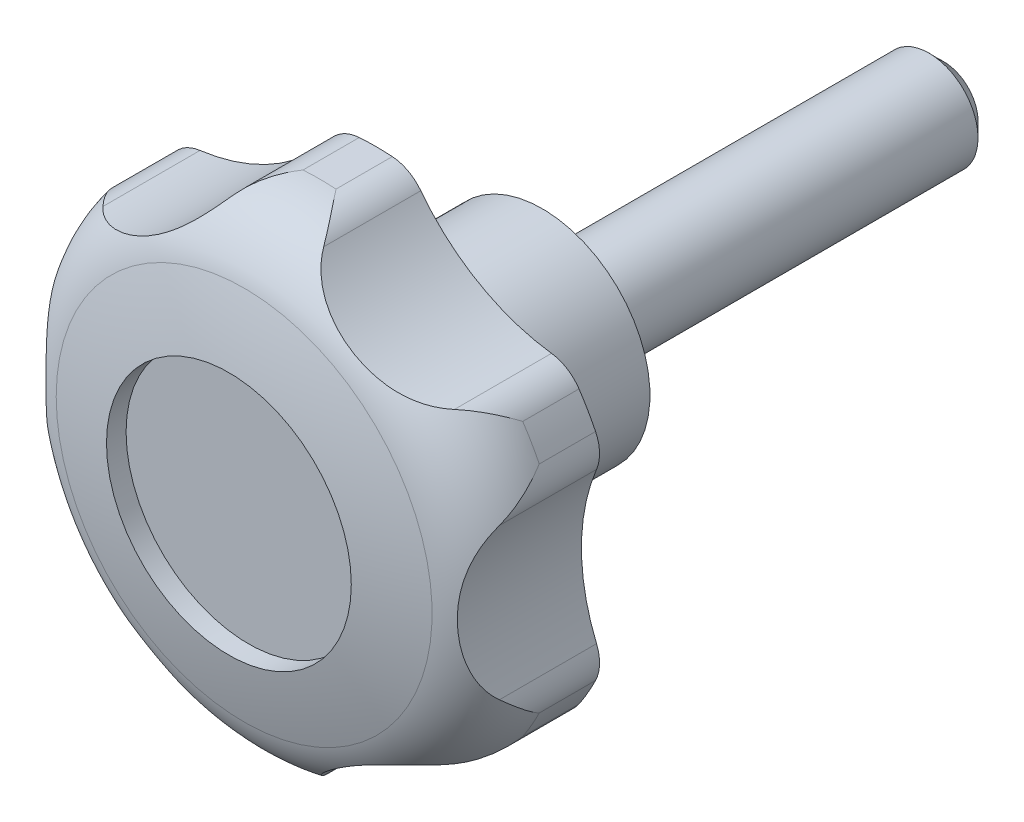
ISO-10303-21;
HEADER;
FILE_DESCRIPTION(('STEP AP214'),'2;1');
FILE_NAME('part.step','',(''),(''),'','','');
FILE_SCHEMA(('AUTOMOTIVE_DESIGN { 1 0 10303 214 1 1 1 1 }'));
ENDSEC;
DATA;
#1=APPLICATION_CONTEXT('core data for automotive mechanical design processes');
#2=APPLICATION_PROTOCOL_DEFINITION('international standard','automotive_design',2000,#1);
#3=PRODUCT_CONTEXT('',#1,'mechanical');
#4=PRODUCT('Part','Part','',(#3));
#5=PRODUCT_RELATED_PRODUCT_CATEGORY('part','',(#4));
#6=PRODUCT_DEFINITION_FORMATION('','',#4);
#7=PRODUCT_DEFINITION_CONTEXT('part definition',#1,'design');
#8=PRODUCT_DEFINITION('design','',#6,#7);
#9=PRODUCT_DEFINITION_SHAPE('','',#8);
#10=(LENGTH_UNIT() NAMED_UNIT(*) SI_UNIT(.MILLI.,.METRE.));
#11=(NAMED_UNIT(*) PLANE_ANGLE_UNIT() SI_UNIT($,.RADIAN.));
#12=(NAMED_UNIT(*) SI_UNIT($,.STERADIAN.) SOLID_ANGLE_UNIT());
#13=UNCERTAINTY_MEASURE_WITH_UNIT(LENGTH_MEASURE(1.E-05),#10,'distance_accuracy_value','');
#14=(GEOMETRIC_REPRESENTATION_CONTEXT(3) GLOBAL_UNCERTAINTY_ASSIGNED_CONTEXT((#13)) GLOBAL_UNIT_ASSIGNED_CONTEXT((#10,
#11,#12)) REPRESENTATION_CONTEXT('',''));
#15=CARTESIAN_POINT('',(0.,0.,0.));
#16=DIRECTION('',(0.,0.,1.));
#17=DIRECTION('',(1.,0.,0.));
#18=AXIS2_PLACEMENT_3D('',#15,#16,#17);
#19=CARTESIAN_POINT('',(0.,0.,46.4987648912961));
#20=DIRECTION('',(0.,0.,1.));
#21=DIRECTION('',(-1.,0.,0.));
#22=AXIS2_PLACEMENT_3D('',#19,#20,#21);
#23=CYLINDRICAL_SURFACE('',#22,25.);
#24=CARTESIAN_POINT('',(0.,0.,18.));
#25=DIRECTION('',(0.,0.,1.));
#26=DIRECTION('',(-1.,0.,0.));
#27=AXIS2_PLACEMENT_3D('',#24,#25,#26);
#28=CIRCLE('',#27,25.);
#29=CARTESIAN_POINT('',(22.4448315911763,11.010428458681,18.));
#30=VERTEX_POINT('',#29);
#31=CARTESIAN_POINT('',(20.7577265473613,13.9325801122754,18.));
#32=VERTEX_POINT('',#31);
#33=EDGE_CURVE('E440',#30,#32,#28,.T.);
#34=ORIENTED_EDGE('',*,*,#33,.T.);
#35=DIRECTION('',(0.,0.,1.));
#36=VECTOR('',#35,1.);
#37=CARTESIAN_POINT('',(20.7577265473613,13.9325801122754,-39.));
#38=LINE('',#37,#36);
#39=CARTESIAN_POINT('',(20.7577265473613,13.9325801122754,23.748934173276));
#40=VERTEX_POINT('',#39);
#41=EDGE_CURVE('E182',#32,#40,#38,.T.);
#42=ORIENTED_EDGE('',*,*,#41,.T.);
#43=CARTESIAN_POINT('',(0.,0.,23.748934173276));
#44=DIRECTION('',(0.,0.,1.));
#45=DIRECTION('',(-1.,0.,0.));
#46=AXIS2_PLACEMENT_3D('',#43,#44,#45);
#47=CIRCLE('',#46,25.);
#48=CARTESIAN_POINT('',(22.4448315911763,11.010428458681,23.748934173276));
#49=VERTEX_POINT('',#48);
#50=EDGE_CURVE('E198',#49,#40,#47,.T.);
#51=ORIENTED_EDGE('',*,*,#50,.F.);
#52=DIRECTION('',(0.,0.,1.));
#53=VECTOR('',#52,1.);
#54=CARTESIAN_POINT('',(22.4448315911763,11.010428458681,-39.));
#55=LINE('',#54,#53);
#56=EDGE_CURVE('E615',#30,#49,#55,.T.);
#57=ORIENTED_EDGE('',*,*,#56,.F.);
#58=EDGE_LOOP('',(#34,#42,#51,#57));
#59=FACE_BOUND('',#58,.T.);
#60=ADVANCED_FACE('F14',(#59),#23,.T.);
#61=CARTESIAN_POINT('',(20.7577265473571,-13.9325801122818,18.));
#62=VERTEX_POINT('',#61);
#63=CARTESIAN_POINT('',(22.444831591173,-11.010428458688,18.));
#64=VERTEX_POINT('',#63);
#65=EDGE_CURVE('E441',#62,#64,#28,.T.);
#66=ORIENTED_EDGE('',*,*,#65,.T.);
#67=DIRECTION('',(0.,0.,1.));
#68=VECTOR('',#67,1.);
#69=CARTESIAN_POINT('',(22.444831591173,-11.010428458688,-39.));
#70=LINE('',#69,#68);
#71=CARTESIAN_POINT('',(22.444831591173,-11.010428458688,23.748934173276));
#72=VERTEX_POINT('',#71);
#73=EDGE_CURVE('E607',#64,#72,#70,.T.);
#74=ORIENTED_EDGE('',*,*,#73,.T.);
#75=CARTESIAN_POINT('',(20.7577265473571,-13.9325801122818,23.748934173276));
#76=VERTEX_POINT('',#75);
#77=EDGE_CURVE('E622',#76,#72,#47,.T.);
#78=ORIENTED_EDGE('',*,*,#77,.F.);
#79=DIRECTION('',(0.,0.,1.));
#80=VECTOR('',#79,1.);
#81=CARTESIAN_POINT('',(20.7577265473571,-13.9325801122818,-39.));
#82=LINE('',#81,#80);
#83=EDGE_CURVE('E605',#62,#76,#82,.T.);
#84=ORIENTED_EDGE('',*,*,#83,.F.);
#85=EDGE_LOOP('',(#66,#74,#78,#84));
#86=FACE_BOUND('',#85,.T.);
#87=ADVANCED_FACE('F404',(#86),#23,.T.);
#88=CARTESIAN_POINT('',(-1.68710504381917,-24.943008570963,18.));
#89=VERTEX_POINT('',#88);
#90=CARTESIAN_POINT('',(1.68710504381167,-24.9430085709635,18.));
#91=VERTEX_POINT('',#90);
#92=EDGE_CURVE('E447',#89,#91,#28,.T.);
#93=ORIENTED_EDGE('',*,*,#92,.T.);
#94=DIRECTION('',(0.,0.,1.));
#95=VECTOR('',#94,1.);
#96=CARTESIAN_POINT('',(1.68710504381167,-24.9430085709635,-39.));
#97=LINE('',#96,#95);
#98=CARTESIAN_POINT('',(1.68710504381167,-24.9430085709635,23.748934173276));
#99=VERTEX_POINT('',#98);
#100=EDGE_CURVE('E596',#91,#99,#97,.T.);
#101=ORIENTED_EDGE('',*,*,#100,.T.);
#102=CARTESIAN_POINT('',(-1.68710504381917,-24.943008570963,23.748934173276));
#103=VERTEX_POINT('',#102);
#104=EDGE_CURVE('E452',#103,#99,#47,.T.);
#105=ORIENTED_EDGE('',*,*,#104,.F.);
#106=DIRECTION('',(0.,0.,1.));
#107=VECTOR('',#106,1.);
#108=CARTESIAN_POINT('',(-1.68710504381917,-24.943008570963,-39.));
#109=LINE('',#108,#107);
#110=EDGE_CURVE('E594',#89,#103,#109,.T.);
#111=ORIENTED_EDGE('',*,*,#110,.F.);
#112=EDGE_LOOP('',(#93,#101,#105,#111));
#113=FACE_BOUND('',#112,.T.);
#114=ADVANCED_FACE('F412',(#113),#23,.T.);
#115=CARTESIAN_POINT('',(-22.4448315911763,-11.0104284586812,18.));
#116=VERTEX_POINT('',#115);
#117=CARTESIAN_POINT('',(-20.7577265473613,-13.9325801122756,18.));
#118=VERTEX_POINT('',#117);
#119=EDGE_CURVE('E443',#116,#118,#28,.T.);
#120=ORIENTED_EDGE('',*,*,#119,.T.);
#121=DIRECTION('',(0.,0.,1.));
#122=VECTOR('',#121,1.);
#123=CARTESIAN_POINT('',(-20.7577265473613,-13.9325801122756,-39.));
#124=LINE('',#123,#122);
#125=CARTESIAN_POINT('',(-20.7577265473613,-13.9325801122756,23.748934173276));
#126=VERTEX_POINT('',#125);
#127=EDGE_CURVE('E585',#118,#126,#124,.T.);
#128=ORIENTED_EDGE('',*,*,#127,.T.);
#129=CARTESIAN_POINT('',(-22.4448315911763,-11.0104284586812,23.748934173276));
#130=VERTEX_POINT('',#129);
#131=EDGE_CURVE('E448',#130,#126,#47,.T.);
#132=ORIENTED_EDGE('',*,*,#131,.F.);
#133=DIRECTION('',(0.,0.,1.));
#134=VECTOR('',#133,1.);
#135=CARTESIAN_POINT('',(-22.4448315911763,-11.0104284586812,-39.));
#136=LINE('',#135,#134);
#137=EDGE_CURVE('E583',#116,#130,#136,.T.);
#138=ORIENTED_EDGE('',*,*,#137,.F.);
#139=EDGE_LOOP('',(#120,#128,#132,#138));
#140=FACE_BOUND('',#139,.T.);
#141=ADVANCED_FACE('F427',(#140),#23,.T.);
#142=CARTESIAN_POINT('',(-20.7577265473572,13.9325801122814,18.));
#143=VERTEX_POINT('',#142);
#144=CARTESIAN_POINT('',(-22.444831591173,11.0104284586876,18.));
#145=VERTEX_POINT('',#144);
#146=EDGE_CURVE('E203',#143,#145,#28,.T.);
#147=ORIENTED_EDGE('',*,*,#146,.T.);
#148=DIRECTION('',(0.,0.,1.));
#149=VECTOR('',#148,1.);
#150=CARTESIAN_POINT('',(-22.444831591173,11.0104284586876,-39.));
#151=LINE('',#150,#149);
#152=CARTESIAN_POINT('',(-22.444831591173,11.0104284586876,23.748934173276));
#153=VERTEX_POINT('',#152);
#154=EDGE_CURVE('E37',#145,#153,#151,.T.);
#155=ORIENTED_EDGE('',*,*,#154,.T.);
#156=CARTESIAN_POINT('',(-20.7577265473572,13.9325801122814,23.748934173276));
#157=VERTEX_POINT('',#156);
#158=EDGE_CURVE('E446',#157,#153,#47,.T.);
#159=ORIENTED_EDGE('',*,*,#158,.F.);
#160=DIRECTION('',(0.,0.,1.));
#161=VECTOR('',#160,1.);
#162=CARTESIAN_POINT('',(-20.7577265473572,13.9325801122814,-39.));
#163=LINE('',#162,#161);
#164=EDGE_CURVE('E574',#143,#157,#163,.T.);
#165=ORIENTED_EDGE('',*,*,#164,.F.);
#166=EDGE_LOOP('',(#147,#155,#159,#165));
#167=FACE_BOUND('',#166,.T.);
#168=ADVANCED_FACE('F417',(#167),#23,.T.);
#169=CARTESIAN_POINT('',(1.68710504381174,24.943008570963,18.));
#170=VERTEX_POINT('',#169);
#171=CARTESIAN_POINT('',(-1.68710504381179,24.943008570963,18.));
#172=VERTEX_POINT('',#171);
#173=EDGE_CURVE('E433',#170,#172,#28,.T.);
#174=ORIENTED_EDGE('',*,*,#173,.T.);
#175=DIRECTION('',(0.,0.,1.));
#176=VECTOR('',#175,1.);
#177=CARTESIAN_POINT('',(-1.6871050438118,24.943008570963,-39.));
#178=LINE('',#177,#176);
#179=CARTESIAN_POINT('',(-1.6871050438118,24.943008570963,23.748934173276));
#180=VERTEX_POINT('',#179);
#181=EDGE_CURVE('E435',#172,#180,#178,.T.);
#182=ORIENTED_EDGE('',*,*,#181,.T.);
#183=CARTESIAN_POINT('',(1.68710504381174,24.943008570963,23.748934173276));
#184=VERTEX_POINT('',#183);
#185=EDGE_CURVE('E621',#184,#180,#47,.T.);
#186=ORIENTED_EDGE('',*,*,#185,.F.);
#187=DIRECTION('',(0.,0.,1.));
#188=VECTOR('',#187,1.);
#189=CARTESIAN_POINT('',(1.68710504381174,24.943008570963,-39.));
#190=LINE('',#189,#188);
#191=EDGE_CURVE('E437',#170,#184,#190,.T.);
#192=ORIENTED_EDGE('',*,*,#191,.F.);
#193=EDGE_LOOP('',(#174,#182,#186,#192));
#194=FACE_BOUND('',#193,.T.);
#195=ADVANCED_FACE('F406',(#194),#23,.T.);
#196=CARTESIAN_POINT('',(0.,0.,46.4987648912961));
#197=DIRECTION('',(0.,0.,1.));
#198=DIRECTION('',(-1.,0.,0.));
#199=AXIS2_PLACEMENT_3D('',#196,#197,#198);
#200=CYLINDRICAL_SURFACE('',#199,11.);
#201=CARTESIAN_POINT('',(0.,0.,1.));
#202=DIRECTION('',(0.,0.,1.));
#203=DIRECTION('',(-1.,0.,0.));
#204=AXIS2_PLACEMENT_3D('',#201,#202,#203);
#205=CIRCLE('',#204,11.);
#206=CARTESIAN_POINT('',(-11.,0.,1.));
#207=VERTEX_POINT('',#206);
#208=EDGE_CURVE('E464',#207,#207,#205,.T.);
#209=ORIENTED_EDGE('',*,*,#208,.T.);
#210=EDGE_LOOP('',(#209));
#211=FACE_BOUND('',#210,.T.);
#212=CARTESIAN_POINT('',(0.,0.,18.));
#213=DIRECTION('',(0.,0.,1.));
#214=DIRECTION('',(-1.,0.,0.));
#215=AXIS2_PLACEMENT_3D('',#212,#213,#214);
#216=CIRCLE('',#215,11.);
#217=CARTESIAN_POINT('',(-11.,0.,18.));
#218=VERTEX_POINT('',#217);
#219=EDGE_CURVE('E199',#218,#218,#216,.T.);
#220=ORIENTED_EDGE('',*,*,#219,.F.);
#221=EDGE_LOOP('',(#220));
#222=FACE_BOUND('',#221,.T.);
#223=ADVANCED_FACE('F416',(#211,#222),#200,.T.);
#224=CARTESIAN_POINT('',(0.,11.,1.));
#225=DIRECTION('',(0.,0.,-1.));
#226=DIRECTION('',(1.,0.,0.));
#227=AXIS2_PLACEMENT_3D('',#224,#225,#226);
#228=PLANE('',#227);
#229=CARTESIAN_POINT('',(0.,0.,1.));
#230=DIRECTION('',(0.,0.,1.));
#231=DIRECTION('',(-1.,0.,0.));
#232=AXIS2_PLACEMENT_3D('',#229,#230,#231);
#233=CIRCLE('',#232,7.00000000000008);
#234=CARTESIAN_POINT('',(-7.00000000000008,0.,1.));
#235=VERTEX_POINT('',#234);
#236=EDGE_CURVE('E461',#235,#235,#233,.T.);
#237=ORIENTED_EDGE('',*,*,#236,.T.);
#238=EDGE_LOOP('',(#237));
#239=FACE_BOUND('',#238,.T.);
#240=ORIENTED_EDGE('',*,*,#208,.F.);
#241=EDGE_LOOP('',(#240));
#242=FACE_BOUND('',#241,.T.);
#243=ADVANCED_FACE('F424',(#239,#242),#228,.T.);
#244=CARTESIAN_POINT('',(0.,0.,46.4987648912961));
#245=DIRECTION('',(0.,0.,1.));
#246=DIRECTION('',(-1.,0.,0.));
#247=AXIS2_PLACEMENT_3D('',#244,#245,#246);
#248=CYLINDRICAL_SURFACE('',#247,7.00000000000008);
#249=CARTESIAN_POINT('',(0.,0.,0.));
#250=DIRECTION('',(0.,0.,1.));
#251=DIRECTION('',(-1.,0.,0.));
#252=AXIS2_PLACEMENT_3D('',#249,#250,#251);
#253=CIRCLE('',#252,7.00000000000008);
#254=CARTESIAN_POINT('',(-7.00000000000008,0.,0.));
#255=VERTEX_POINT('',#254);
#256=EDGE_CURVE('E458',#255,#255,#253,.T.);
#257=ORIENTED_EDGE('',*,*,#256,.T.);
#258=EDGE_LOOP('',(#257));
#259=FACE_BOUND('',#258,.T.);
#260=ORIENTED_EDGE('',*,*,#236,.F.);
#261=EDGE_LOOP('',(#260));
#262=FACE_BOUND('',#261,.T.);
#263=ADVANCED_FACE('F880',(#259,#262),#248,.T.);
#264=CARTESIAN_POINT('',(0.,3.88317009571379,0.));
#265=DIRECTION('',(0.,0.,1.));
#266=DIRECTION('',(-1.,0.,0.));
#267=AXIS2_PLACEMENT_3D('',#264,#265,#266);
#268=PLANE('',#267);
#269=CARTESIAN_POINT('',(0.,0.,0.));
#270=DIRECTION('',(0.,0.,1.));
#271=DIRECTION('',(1.,0.,0.));
#272=AXIS2_PLACEMENT_3D('',#269,#270,#271);
#273=CIRCLE('',#272,4.65);
#274=CARTESIAN_POINT('',(4.65,0.,0.));
#275=VERTEX_POINT('',#274);
#276=EDGE_CURVE('E516',#275,#275,#273,.T.);
#277=ORIENTED_EDGE('',*,*,#276,.T.);
#278=EDGE_LOOP('',(#277));
#279=FACE_BOUND('',#278,.T.);
#280=ORIENTED_EDGE('',*,*,#256,.F.);
#281=EDGE_LOOP('',(#280));
#282=FACE_BOUND('',#281,.T.);
#283=ADVANCED_FACE('F890',(#279,#282),#268,.F.);
#284=CARTESIAN_POINT('',(0.,0.,-35.8748865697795));
#285=DIRECTION('',(-1.,0.,0.));
#286=DIRECTION('',(0.,0.,-1.));
#287=AXIS2_PLACEMENT_3D('',#284,#285,#286);
#288=SPHERICAL_SURFACE('',#287,70.);
#289=CARTESIAN_POINT('',(0.,0.,-35.8748865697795));
#290=DIRECTION('',(0.,0.,1.));
#291=DIRECTION('',(-1.,0.,0.));
#292=AXIS2_PLACEMENT_3D('',#289,#290,#291);
#293=SPHERICAL_SURFACE('',#292,70.);
#294=CARTESIAN_POINT('',(0.,0.,31.4423303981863));
#295=DIRECTION('',(0.,0.,1.));
#296=DIRECTION('',(-1.,0.,0.));
#297=AXIS2_PLACEMENT_3D('',#294,#295,#296);
#298=CIRCLE('',#297,19.1935483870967);
#299=CARTESIAN_POINT('',(-19.1935483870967,0.,31.4423303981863));
#300=VERTEX_POINT('',#299);
#301=EDGE_CURVE('E451',#300,#300,#298,.T.);
#302=ORIENTED_EDGE('',*,*,#301,.T.);
#303=EDGE_LOOP('',(#302));
#304=FACE_BOUND('',#303,.T.);
#305=CARTESIAN_POINT('',(0.,0.,33.));
#306=DIRECTION('',(0.,0.,-1.));
#307=DIRECTION('',(1.,0.,0.));
#308=AXIS2_PLACEMENT_3D('',#305,#306,#307);
#309=CIRCLE('',#308,12.5);
#310=CARTESIAN_POINT('',(12.5,0.,33.));
#311=VERTEX_POINT('',#310);
#312=EDGE_CURVE('E560',#311,#311,#309,.T.);
#313=ORIENTED_EDGE('',*,*,#312,.T.);
#314=EDGE_LOOP('',(#313));
#315=FACE_BOUND('',#314,.T.);
#316=ADVANCED_FACE('F900',(#304,#315),#293,.T.);
#317=CARTESIAN_POINT('',(0.,0.,23.748934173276));
#318=DIRECTION('',(0.,0.,1.));
#319=DIRECTION('',(-1.,0.,0.));
#320=AXIS2_PLACEMENT_3D('',#317,#318,#319);
#321=TOROIDAL_SURFACE('',#320,17.,8.);
#322=CARTESIAN_POINT('',(22.444831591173,11.0104284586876,23.748934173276));
#323=CARTESIAN_POINT('',(22.4464357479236,11.0071583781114,23.7536552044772));
#324=CARTESIAN_POINT('',(22.4480354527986,11.0038860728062,23.7583762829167));
#325=CARTESIAN_POINT('',(22.5292989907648,10.8370787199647,23.9988749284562));
#326=CARTESIAN_POINT('',(22.5978518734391,10.6680207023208,24.2347597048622));
#327=CARTESIAN_POINT('',(22.7115523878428,10.3211392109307,24.7057756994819));
#328=CARTESIAN_POINT('',(22.7566913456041,10.1433125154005,24.9409066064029));
#329=CARTESIAN_POINT('',(22.8223990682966,9.78080623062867,25.4099624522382));
#330=CARTESIAN_POINT('',(22.8429294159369,9.59611638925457,25.6438849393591));
#331=CARTESIAN_POINT('',(22.8579355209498,9.22263939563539,26.1090481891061));
#332=CARTESIAN_POINT('',(22.8524280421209,9.0338549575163,26.3402905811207));
#333=CARTESIAN_POINT('',(22.813821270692,8.65409842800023,26.7998440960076));
#334=CARTESIAN_POINT('',(22.7806472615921,8.46312179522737,27.0281455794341));
#335=CARTESIAN_POINT('',(22.7089141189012,8.17797071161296,27.366534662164));
#336=CARTESIAN_POINT('',(22.6813764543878,8.08322589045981,27.4785526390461));
#337=CARTESIAN_POINT('',(22.6187377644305,7.89448609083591,27.7011813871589));
#338=CARTESIAN_POINT('',(22.583633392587,7.80049146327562,27.8117915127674));
#339=CARTESIAN_POINT('',(22.5446319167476,7.70709992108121,27.9215846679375));
#340=B_SPLINE_CURVE_WITH_KNOTS('',3,(#322,#323,#324,#325,#326,#327,#328,#329,#330,#331,#332,
#333,#334,#335,#336,#337,#338,#339),.UNSPECIFIED.,.F.,.F.,(4,2,2,2,2,2,2,2,4),(0.,
0.0178885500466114,0.911260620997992,1.80496341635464,2.70005959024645,3.59457955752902,
4.49152312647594,4.93917199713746,5.38701924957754),.UNSPECIFIED.);
#341=CARTESIAN_POINT('',(22.5447154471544,7.7072999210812,27.9213495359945));
#342=VERTEX_POINT('',#341);
#343=EDGE_CURVE('E200',#49,#342,#340,.T.);
#344=ORIENTED_EDGE('',*,*,#343,.F.);
#345=ORIENTED_EDGE('',*,*,#50,.T.);
#346=CARTESIAN_POINT('',(17.9468752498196,15.670672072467,27.921568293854));
#347=CARTESIAN_POINT('',(18.117798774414,15.648643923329,27.7346266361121));
#348=CARTESIAN_POINT('',(18.2845665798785,15.6160053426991,27.5453205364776));
#349=CARTESIAN_POINT('',(18.6084954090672,15.5314831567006,27.1630391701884));
#350=CARTESIAN_POINT('',(18.765663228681,15.4796133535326,26.9700666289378));
#351=CARTESIAN_POINT('',(19.0689959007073,15.3587065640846,26.5816885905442));
#352=CARTESIAN_POINT('',(19.215185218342,15.289709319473,26.386289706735));
#353=CARTESIAN_POINT('',(19.4960047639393,15.1361526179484,25.9933429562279));
#354=CARTESIAN_POINT('',(19.6306344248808,15.0515923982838,25.7957949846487));
#355=CARTESIAN_POINT('',(19.9555959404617,14.8198368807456,25.2939411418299));
#356=CARTESIAN_POINT('',(20.1376177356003,14.6632025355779,24.9885622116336));
#357=CARTESIAN_POINT('',(20.4694412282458,14.3220932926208,24.3764105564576));
#358=CARTESIAN_POINT('',(20.6192843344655,14.1376547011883,24.0696401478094));
#359=CARTESIAN_POINT('',(20.7536626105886,13.9386259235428,23.7583762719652));
#360=CARTESIAN_POINT('',(20.7556966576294,13.9356043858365,23.7536551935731));
#361=CARTESIAN_POINT('',(20.7577265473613,13.9325801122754,23.748934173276));
#362=B_SPLINE_CURVE_WITH_KNOTS('',3,(#346,#347,#348,#349,#350,#351,#352,#353,#354,#355,#356,
#357,#358,#359,#360,#361),.UNSPECIFIED.,.F.,.F.,(4,2,2,2,2,2,2,4),(0.,0.762311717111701,
1.52407738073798,2.28409173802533,3.04414335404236,4.20715114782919,5.36865325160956,
5.38654180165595),.UNSPECIFIED.);
#363=CARTESIAN_POINT('',(17.9470752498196,15.6706463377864,27.9213495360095));
#364=VERTEX_POINT('',#363);
#365=EDGE_CURVE('E186',#364,#40,#362,.T.);
#366=ORIENTED_EDGE('',*,*,#365,.F.);
#367=CARTESIAN_POINT('',(17.9472752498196,15.670620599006,27.921130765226));
#368=CARTESIAN_POINT('',(17.8000960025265,15.6895370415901,28.0822346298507));
#369=CARTESIAN_POINT('',(17.6451448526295,15.7111642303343,28.2357655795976));
#370=CARTESIAN_POINT('',(17.3223674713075,15.7604215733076,28.5271060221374));
#371=CARTESIAN_POINT('',(17.1545598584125,15.788043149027,28.6649375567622));
#372=CARTESIAN_POINT('',(16.8102495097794,15.8495736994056,28.923305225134));
#373=CARTESIAN_POINT('',(16.6338655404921,15.8834086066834,29.044018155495));
#374=CARTESIAN_POINT('',(16.2729388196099,15.9579775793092,29.2702246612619));
#375=CARTESIAN_POINT('',(16.08839350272,15.9987138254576,29.3757134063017));
#376=CARTESIAN_POINT('',(15.7143264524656,16.0871013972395,29.5714668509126));
#377=CARTESIAN_POINT('',(15.5248361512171,16.1347150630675,29.661809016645));
#378=CARTESIAN_POINT('',(15.1418469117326,16.2371300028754,29.8287610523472));
#379=CARTESIAN_POINT('',(14.9483483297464,16.2919306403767,29.9053721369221));
#380=CARTESIAN_POINT('',(14.558355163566,16.4089153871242,30.0460657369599));
#381=CARTESIAN_POINT('',(14.3618533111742,16.4711212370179,30.1101098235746));
#382=CARTESIAN_POINT('',(13.9677629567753,16.6027276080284,30.2264374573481));
#383=CARTESIAN_POINT('',(13.7701742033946,16.6721298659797,30.2787181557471));
#384=CARTESIAN_POINT('',(13.2568720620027,16.8616609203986,30.4006076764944));
#385=CARTESIAN_POINT('',(12.941186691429,16.9873034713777,30.4618798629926));
#386=CARTESIAN_POINT('',(12.313507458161,17.2560665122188,30.5606509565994));
#387=CARTESIAN_POINT('',(12.0015155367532,17.3991957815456,30.5981378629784));
#388=CARTESIAN_POINT('',(11.3830678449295,17.7025343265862,30.6519278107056));
#389=CARTESIAN_POINT('',(11.0766289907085,17.8627879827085,30.6681742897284));
#390=CARTESIAN_POINT('',(10.4722361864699,18.1991370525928,30.6804878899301));
#391=CARTESIAN_POINT('',(10.1742808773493,18.3752299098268,30.6765582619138));
#392=CARTESIAN_POINT('',(9.58255501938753,18.7459626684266,30.6479465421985));
#393=CARTESIAN_POINT('',(9.28899683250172,18.9409097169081,30.6228389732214));
#394=CARTESIAN_POINT('',(8.71439077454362,19.3446564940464,30.5494207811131));
#395=CARTESIAN_POINT('',(8.43334617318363,19.5534598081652,30.5011041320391));
#396=CARTESIAN_POINT('',(7.88706048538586,19.9817784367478,30.3782042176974));
#397=CARTESIAN_POINT('',(7.62176755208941,20.2012537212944,30.3037134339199));
#398=CARTESIAN_POINT('',(7.10876905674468,20.6480271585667,30.1242106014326));
#399=CARTESIAN_POINT('',(6.86104855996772,20.8753184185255,30.019224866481));
#400=CARTESIAN_POINT('',(6.48058176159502,21.2418536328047,29.8228937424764));
#401=CARTESIAN_POINT('',(6.34121880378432,21.3802460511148,29.7426671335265));
#402=CARTESIAN_POINT('',(6.07081213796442,21.656560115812,29.5685988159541));
#403=CARTESIAN_POINT('',(5.93976564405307,21.7944819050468,29.4747617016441));
#404=CARTESIAN_POINT('',(5.68708094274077,22.0678451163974,29.272998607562));
#405=CARTESIAN_POINT('',(5.56542019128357,22.2032918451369,29.1651081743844));
#406=CARTESIAN_POINT('',(5.33197442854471,22.4700784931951,28.9346793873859));
#407=CARTESIAN_POINT('',(5.22018481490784,22.6014203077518,28.8121479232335));
#408=CARTESIAN_POINT('',(5.01910520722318,22.8435588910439,28.5669102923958));
#409=CARTESIAN_POINT('',(4.92869795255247,22.9550077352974,28.4457651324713));
#410=CARTESIAN_POINT('',(4.75649074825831,23.1716770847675,28.1919642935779));
#411=CARTESIAN_POINT('',(4.67470230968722,23.2768891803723,28.0592936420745));
#412=CARTESIAN_POINT('',(4.59748765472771,23.3781462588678,27.92107664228));
#413=B_SPLINE_CURVE_WITH_KNOTS('',3,(#367,#368,#369,#370,#371,#372,#373,#374,#375,#376,#377,
#378,#379,#380,#381,#382,#383,#384,#385,#386,#387,#388,#389,#390,#391,#392,#393,#394,#395,#396,
#397,#398,#399,#400,#401,#402,#403,#404,#405,#406,#407,#408,#409,#410,#411,#412),.UNSPECIFIED.,
.F.,.F.,(4,2,2,2,2,2,2,2,2,2,2,2,2,2,2,2,2,2,2,2,2,2,4),(0.,0.656644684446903,1.31235577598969,
1.96070546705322,2.60926041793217,3.25438989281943,3.89946227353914,4.54647750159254,
5.19364925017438,6.22787361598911,7.26261937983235,8.30011505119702,9.33744356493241,
10.3961231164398,11.4550776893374,12.5103276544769,13.5646697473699,14.2006301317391,
14.8363763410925,15.4705446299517,16.1044156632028,16.6671921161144,17.2307109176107),.UNSPECIFIED.);
#414=CARTESIAN_POINT('',(4.59764019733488,23.3779462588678,27.921349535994));
#415=VERTEX_POINT('',#414);
#416=EDGE_CURVE('E174',#364,#415,#413,.T.);
#417=ORIENTED_EDGE('',*,*,#416,.T.);
#418=CARTESIAN_POINT('',(1.68710504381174,24.943008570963,23.748934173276));
#419=CARTESIAN_POINT('',(1.69073909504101,24.9427627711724,23.7536552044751));
#420=CARTESIAN_POINT('',(1.69437284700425,24.94251200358,23.7583762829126));
#421=CARTESIAN_POINT('',(1.87946401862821,24.9294846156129,23.998874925));
#422=CARTESIAN_POINT('',(2.06014899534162,24.9043241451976,24.2347596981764));
#423=CARTESIAN_POINT('',(2.41740743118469,24.8293509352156,24.7057756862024));
#424=CARTESIAN_POINT('',(2.59397934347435,24.7795290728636,24.9409065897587));
#425=CARTESIAN_POINT('',(2.94077285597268,24.6551804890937,25.4099624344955));
#426=CARTESIAN_POINT('',(3.11098412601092,24.5806153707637,25.6438849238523));
#427=CARTESIAN_POINT('',(3.4419277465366,24.406872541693,26.1090481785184));
#428=CARTESIAN_POINT('',(3.60266612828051,24.3077107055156,26.3402905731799));
#429=CARTESIAN_POINT('',(3.91224597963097,24.0843947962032,26.7998506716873));
#430=CARTESIAN_POINT('',(4.06105367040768,23.9601730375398,27.0281586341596));
#431=CARTESIAN_POINT('',(4.27214053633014,23.7554678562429,27.36655718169));
#432=CARTESIAN_POINT('',(4.34042478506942,23.6842446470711,27.4785782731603));
#433=CARTESIAN_POINT('',(4.47256192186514,23.5356227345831,27.7012131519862));
#434=CARTESIAN_POINT('',(4.53641283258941,23.4582213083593,27.8118262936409));
#435=CARTESIAN_POINT('',(4.59779273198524,23.3777462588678,27.9216224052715));
#436=B_SPLINE_CURVE_WITH_KNOTS('',3,(#418,#419,#420,#421,#422,#423,#424,#425,#426,#427,#428,
#429,#430,#431,#432,#433,#434,#435),.UNSPECIFIED.,.F.,.F.,(4,2,2,2,2,2,2,2,4),(0.,
0.0178885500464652,0.911260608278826,1.80496339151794,2.70005957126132,3.59457955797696,
4.49154874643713,4.93921044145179,5.38707053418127),.UNSPECIFIED.);
#437=EDGE_CURVE('E181',#184,#415,#436,.T.);
#438=ORIENTED_EDGE('',*,*,#437,.F.);
#439=ORIENTED_EDGE('',*,*,#185,.T.);
#440=CARTESIAN_POINT('',(-4.5977927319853,23.3777462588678,27.9216224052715));
#441=CARTESIAN_POINT('',(-4.493256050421,23.514757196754,27.7346823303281));
#442=CARTESIAN_POINT('',(-4.38160827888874,23.6428640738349,27.5453777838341));
#443=CARTESIAN_POINT('',(-4.14644934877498,23.8811358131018,27.1630994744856));
#444=CARTESIAN_POINT('',(-4.02294674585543,23.9913134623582,26.9701284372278));
#445=CARTESIAN_POINT('',(-3.76657567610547,24.1935565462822,26.5817533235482));
#446=CARTESIAN_POINT('',(-3.63372939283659,24.2856630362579,26.3863558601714));
#447=CARTESIAN_POINT('',(-3.36033897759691,24.4520846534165,25.993411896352));
#448=CARTESIAN_POINT('',(-3.21979446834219,24.5263989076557,25.7958652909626));
#449=CARTESIAN_POINT('',(-2.85660155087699,24.6919550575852,25.2940011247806));
#450=CARTESIAN_POINT('',(-2.62993299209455,24.7712789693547,24.9886102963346));
#451=CARTESIAN_POINT('',(-2.16859445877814,24.8880997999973,24.3764346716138));
#452=CARTESIAN_POINT('',(-1.93393522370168,24.9256507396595,24.0696521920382));
#453=CARTESIAN_POINT('',(-1.69437283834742,24.942512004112,23.7583762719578));
#454=CARTESIAN_POINT('',(-1.69073908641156,24.9427627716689,23.7536551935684));
#455=CARTESIAN_POINT('',(-1.68710504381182,24.943008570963,23.748934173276));
#456=B_SPLINE_CURVE_WITH_KNOTS('',3,(#440,#441,#442,#443,#444,#445,#446,#447,#448,#449,#450,
#451,#452,#453,#454,#455),.UNSPECIFIED.,.F.,.F.,(4,2,2,2,2,2,2,4),(0.,0.762307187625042,
1.52406829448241,2.284078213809,3.0441254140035,4.20717896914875,5.36872670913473,
5.38661525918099),.UNSPECIFIED.);
#457=CARTESIAN_POINT('',(-4.59764019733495,23.3779462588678,27.9213495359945));
#458=VERTEX_POINT('',#457);
#459=EDGE_CURVE('E249',#458,#180,#456,.T.);
#460=ORIENTED_EDGE('',*,*,#459,.F.);
#461=CARTESIAN_POINT('',(-4.59748765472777,23.3781462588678,27.92107664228));
#462=CARTESIAN_POINT('',(-4.68745740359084,23.260145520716,28.0821810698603));
#463=CARTESIAN_POINT('',(-4.78366062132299,23.1367694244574,28.2357127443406));
#464=CARTESIAN_POINT('',(-4.98770324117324,22.8818683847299,28.5270549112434));
#465=CARTESIAN_POINT('',(-5.09552590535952,22.7503552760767,28.6648874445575));
#466=CARTESIAN_POINT('',(-5.32096382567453,22.4829423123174,28.9232573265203));
#467=CARTESIAN_POINT('',(-5.43845555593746,22.3471082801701,29.0439714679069));
#468=CARTESIAN_POINT('',(-5.68349322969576,22.0718238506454,29.2701805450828));
#469=CARTESIAN_POINT('',(-5.81104234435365,21.9323723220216,29.3756706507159));
#470=CARTESIAN_POINT('',(-6.0746174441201,21.652616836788,29.5714269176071));
#471=CARTESIAN_POINT('',(-6.21059510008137,21.5123212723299,29.6617705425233));
#472=CARTESIAN_POINT('',(-6.49077939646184,21.2318521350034,29.8287255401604));
#473=CARTESIAN_POINT('',(-6.6349853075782,21.091678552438,29.9053381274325));
#474=CARTESIAN_POINT('',(-6.93128941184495,20.81242830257,30.046034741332));
#475=CARTESIAN_POINT('',(-7.08341006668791,20.6733562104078,30.1100803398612));
#476=CARTESIAN_POINT('',(-7.39442549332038,20.3978680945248,30.226410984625));
#477=CARTESIAN_POINT('',(-7.55332189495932,20.2614527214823,30.2786931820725));
#478=CARTESIAN_POINT('',(-7.97410593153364,19.9116865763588,30.4005864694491));
#479=CARTESIAN_POINT('',(-8.24075460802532,19.7011167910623,30.4618609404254));
#480=CARTESIAN_POINT('',(-8.78734257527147,19.2919126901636,30.5606366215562));
#481=CARTESIAN_POINT('',(-9.06728849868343,19.0932844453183,30.5981258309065));
#482=CARTESIAN_POINT('',(-9.63920400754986,18.7093620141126,30.6519204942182));
#483=CARTESIAN_POINT('',(-9.93120356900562,18.5241046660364,30.6681693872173));
#484=CARTESIAN_POINT('',(-10.5246796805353,18.1688586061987,30.6804880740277));
#485=CARTESIAN_POINT('',(-10.8261546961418,17.9988674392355,30.6765611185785));
#486=CARTESIAN_POINT('',(-11.4430750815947,17.6717820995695,30.6479552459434));
#487=CARTESIAN_POINT('',(-11.7586802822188,17.5150254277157,30.6228508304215));
#488=CARTESIAN_POINT('',(-12.3956325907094,17.2192723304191,30.5494396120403));
#489=CARTESIAN_POINT('',(-12.7169811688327,17.0802805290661,30.5011267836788));
#490=CARTESIAN_POINT('',(-13.3610540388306,16.8213387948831,30.3782353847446));
#491=CARTESIAN_POINT('',(-13.6837695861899,16.7013239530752,30.3037492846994));
#492=CARTESIAN_POINT('',(-14.3271826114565,16.4804364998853,30.1242568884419));
#493=CARTESIAN_POINT('',(-14.6478815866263,16.3795475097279,30.019276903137));
#494=CARTESIAN_POINT('',(-15.1555460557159,16.2333162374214,29.8229545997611));
#495=CARTESIAN_POINT('',(-15.3450819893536,16.1818181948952,29.7427304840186));
#496=CARTESIAN_POINT('',(-15.719586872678,16.0857915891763,29.5686670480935));
#497=CARTESIAN_POINT('',(-15.9045573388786,16.0412606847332,29.4748323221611));
#498=CARTESIAN_POINT('',(-16.2676463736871,15.959106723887,29.2730738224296));
#499=CARTESIAN_POINT('',(-16.4457808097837,15.9214667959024,29.1651855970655));
#500=CARTESIAN_POINT('',(-16.7935555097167,15.8526864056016,28.9347609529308));
#501=CARTESIAN_POINT('',(-16.9631997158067,15.8215429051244,28.8122314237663));
#502=CARTESIAN_POINT('',(-17.2734523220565,15.7684678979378,28.5669917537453));
#503=CARTESIAN_POINT('',(-17.4151836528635,15.7458950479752,28.4458421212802));
#504=CARTESIAN_POINT('',(-17.6889479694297,15.7050898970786,28.192030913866));
#505=CARTESIAN_POINT('',(-17.8209679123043,15.6868633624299,28.0593543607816));
#506=CARTESIAN_POINT('',(-17.9472752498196,15.670620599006,27.921130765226));
#507=B_SPLINE_CURVE_WITH_KNOTS('',3,(#461,#462,#463,#464,#465,#466,#467,#468,#469,#470,#471,
#472,#473,#474,#475,#476,#477,#478,#479,#480,#481,#482,#483,#484,#485,#486,#487,#488,#489,#490,
#491,#492,#493,#494,#495,#496,#497,#498,#499,#500,#501,#502,#503,#504,#505,#506),.UNSPECIFIED.,
.F.,.F.,(4,2,2,2,2,2,2,2,2,2,2,2,2,2,2,2,2,2,2,2,2,2,4),(0.,0.656640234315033,1.31234690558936,
1.9606922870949,2.60924292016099,3.25436818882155,3.89943636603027,4.54644734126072,
5.1936148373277,6.22783106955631,7.26256869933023,8.30005616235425,9.33737647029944,
10.3960491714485,11.4549968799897,12.5102403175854,13.5645759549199,14.2005435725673,
14.8362970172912,15.4704724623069,16.1043506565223,16.667159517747,17.2307109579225),.UNSPECIFIED.);
#508=CARTESIAN_POINT('',(-17.9470752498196,15.6706463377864,27.921349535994));
#509=VERTEX_POINT('',#508);
#510=EDGE_CURVE('E255',#458,#509,#507,.T.);
#511=ORIENTED_EDGE('',*,*,#510,.T.);
#512=CARTESIAN_POINT('',(-20.7577265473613,13.9325801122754,23.748934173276));
#513=CARTESIAN_POINT('',(-20.7556966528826,13.9356043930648,23.7536552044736));
#514=CARTESIAN_POINT('',(-20.7536626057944,13.9386259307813,23.7583762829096));
#515=CARTESIAN_POINT('',(-20.6498349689,14.0924058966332,23.9988749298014));
#516=CARTESIAN_POINT('',(-20.537702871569,14.2363034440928,24.2347597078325));
#517=CARTESIAN_POINT('',(-20.2941449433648,14.5082117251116,24.7057757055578));
#518=CARTESIAN_POINT('',(-20.1627119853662,14.6362165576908,24.9409066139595));
#519=CARTESIAN_POINT('',(-19.8816261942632,14.8743742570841,25.4099624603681));
#520=CARTESIAN_POINT('',(-19.7319452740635,14.9844989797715,25.6438849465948));
#521=CARTESIAN_POINT('',(-19.4160077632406,15.1842331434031,26.109048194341));
#522=CARTESIAN_POINT('',(-19.2497619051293,15.273855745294,26.3402905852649));
#523=CARTESIAN_POINT('',(-18.9015818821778,15.4302985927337,26.7998412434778));
#524=CARTESIAN_POINT('',(-18.719606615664,15.4970566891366,27.0281399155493));
#525=CARTESIAN_POINT('',(-18.4367957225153,15.5775089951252,27.3665248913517));
#526=CARTESIAN_POINT('',(-18.3409767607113,15.6010330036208,27.4785415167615));
#527=CARTESIAN_POINT('',(-18.1462066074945,15.6411562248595,27.7011676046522));
#528=CARTESIAN_POINT('',(-18.0472540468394,15.6577523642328,27.811776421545));
#529=CARTESIAN_POINT('',(-17.9468752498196,15.670672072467,27.9215682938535));
#530=B_SPLINE_CURVE_WITH_KNOTS('',3,(#512,#513,#514,#515,#516,#517,#518,#519,#520,#521,#522,
#523,#524,#525,#526,#527,#528,#529),.UNSPECIFIED.,.F.,.F.,(4,2,2,2,2,2,2,2,4),(0.,
0.0178885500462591,0.911260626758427,1.80496342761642,2.70005959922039,3.59457955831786,
4.49151201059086,4.93915531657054,5.38699699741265),.UNSPECIFIED.);
#531=EDGE_CURVE('E278',#157,#509,#530,.T.);
#532=ORIENTED_EDGE('',*,*,#531,.F.);
#533=ORIENTED_EDGE('',*,*,#158,.T.);
#534=CARTESIAN_POINT('',(-22.5446319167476,7.70709992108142,27.9215846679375));
#535=CARTESIAN_POINT('',(-22.6110172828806,7.86613771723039,27.7346434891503));
#536=CARTESIAN_POINT('',(-22.66613590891,8.02688180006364,27.5453378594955));
#537=CARTESIAN_POINT('',(-22.7549031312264,8.34967281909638,27.1630574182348));
#538=CARTESIAN_POINT('',(-22.7885670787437,8.51171873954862,26.9700853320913));
#539=CARTESIAN_POINT('',(-22.8355263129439,8.83486539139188,26.5817081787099));
#540=CARTESIAN_POINT('',(-22.8488682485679,8.99596743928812,26.3863097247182));
#541=CARTESIAN_POINT('',(-22.8562953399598,9.31594223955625,25.9933638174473));
#542=CARTESIAN_POINT('',(-22.8503795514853,9.47481488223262,25.7958162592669));
#543=CARTESIAN_POINT('',(-22.8121555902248,9.87212049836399,25.2939592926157));
#544=CARTESIAN_POINT('',(-22.7675173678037,10.1080762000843,24.9885767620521));
#545=CARTESIAN_POINT('',(-22.6380192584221,10.5660041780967,24.3764178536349));
#546=CARTESIAN_POINT('',(-22.5532115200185,10.7879941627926,24.0696437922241));
#547=CARTESIAN_POINT('',(-22.4480354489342,11.0038860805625,23.7583762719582));
#548=CARTESIAN_POINT('',(-22.4464357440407,11.0071583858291,23.7536551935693));
#549=CARTESIAN_POINT('',(-22.444831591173,11.0104284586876,23.748934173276));
#550=B_SPLINE_CURVE_WITH_KNOTS('',3,(#534,#535,#536,#537,#538,#539,#540,#541,#542,#543,#544,
#545,#546,#547,#548,#549),.UNSPECIFIED.,.F.,.F.,(4,2,2,2,2,2,2,4),(0.,0.762310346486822,
1.52407463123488,2.28408764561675,3.04413792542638,4.20715956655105,5.3686754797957,
5.386564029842),.UNSPECIFIED.);
#551=CARTESIAN_POINT('',(-22.5447154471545,7.70729992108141,27.9213495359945));
#552=VERTEX_POINT('',#551);
#553=EDGE_CURVE('E284',#552,#153,#550,.T.);
#554=ORIENTED_EDGE('',*,*,#553,.F.);
#555=CARTESIAN_POINT('',(-22.5447989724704,7.70749992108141,27.921114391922));
#556=CARTESIAN_POINT('',(-22.4875916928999,7.57058155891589,28.0822184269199));
#557=CARTESIAN_POINT('',(-22.428846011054,7.42557716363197,28.2357495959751));
#558=CARTESIAN_POINT('',(-22.3101157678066,7.12141673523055,28.5270905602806));
#559=CARTESIAN_POINT('',(-22.2501330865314,6.96228111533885,28.6649223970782));
#560=CARTESIAN_POINT('',(-22.1312651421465,6.63333594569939,28.9232907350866));
#561=CARTESIAN_POINT('',(-22.0723751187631,6.4636662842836,29.0440040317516));
#562=CARTESIAN_POINT('',(-21.9564904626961,6.11381164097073,29.2702113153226));
#563=CARTESIAN_POINT('',(-21.899496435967,5.93362334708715,29.3757004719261));
#564=CARTESIAN_POINT('',(-21.789008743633,5.56547946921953,29.571454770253));
#565=CARTESIAN_POINT('',(-21.7354981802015,5.37756993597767,29.6617973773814));
#566=CARTESIAN_POINT('',(-21.6326973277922,4.99468544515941,29.8287503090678));
#567=CARTESIAN_POINT('',(-21.5834066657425,4.79971111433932,29.9053618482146));
#568=CARTESIAN_POINT('',(-21.4897215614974,4.40347606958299,30.0460563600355));
#569=CARTESIAN_POINT('',(-21.4453423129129,4.20219819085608,30.1101009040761));
#570=CARTESIAN_POINT('',(-21.362271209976,3.79510399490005,30.2264294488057));
#571=CARTESIAN_POINT('',(-21.3235807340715,3.589286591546,30.2787106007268));
#572=CARTESIAN_POINT('',(-21.2310677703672,3.04999002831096,30.4006012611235));
#573=CARTESIAN_POINT('',(-21.1820343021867,2.7137782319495,30.4618741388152));
#574=CARTESIAN_POINT('',(-21.1009493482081,2.03581253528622,30.5606466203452));
#575=CARTESIAN_POINT('',(-21.0689064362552,1.69405592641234,30.5981342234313));
#576=CARTESIAN_POINT('',(-21.0223803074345,1.00679709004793,30.6519255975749));
#577=CARTESIAN_POINT('',(-21.007943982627,0.661287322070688,30.6681728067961));
#578=CARTESIAN_POINT('',(-20.9970330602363,-0.0303050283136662,30.6804879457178));
#579=CARTESIAN_POINT('',(-21.0005555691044,-0.376387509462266,30.6765591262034));
#580=CARTESIAN_POINT('',(-21.0257550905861,-1.07420211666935,30.647949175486));
#581=CARTESIAN_POINT('',(-21.0478042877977,-1.42590390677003,30.6228425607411));
#582=CARTESIAN_POINT('',(-21.1101545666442,-2.12539970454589,30.549426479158));
#583=CARTESIAN_POINT('',(-21.1504603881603,-2.47319267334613,30.5011109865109));
#584=CARTESIAN_POINT('',(-21.2482506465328,-3.16044858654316,30.3782136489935));
#585=CARTESIAN_POINT('',(-21.3056744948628,-3.499936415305,30.3037242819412));
#586=CARTESIAN_POINT('',(-21.4360907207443,-4.16759265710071,30.1242246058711));
#587=CARTESIAN_POINT('',(-21.5090696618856,-4.4957705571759,30.0192406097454));
#588=CARTESIAN_POINT('',(-21.6362641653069,-5.00853364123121,29.8229120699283));
#589=CARTESIAN_POINT('',(-21.6864339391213,-5.19842309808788,29.7426861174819));
#590=CARTESIAN_POINT('',(-21.7905255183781,-5.57076198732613,29.568619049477));
#591=CARTESIAN_POINT('',(-21.8444460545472,-5.75321390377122,29.4747825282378));
#592=CARTESIAN_POINT('',(-21.9548433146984,-6.1087297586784,29.2730205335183));
#593=CARTESIAN_POINT('',(-22.0113133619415,-6.28181587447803,29.1651306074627));
#594=CARTESIAN_POINT('',(-22.1256348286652,-6.617382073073,28.9347027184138));
#595=CARTESIAN_POINT('',(-22.1834855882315,-6.7798670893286,28.8121716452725));
#596=CARTESIAN_POINT('',(-22.2926436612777,-7.07507705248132,28.5669363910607));
#597=CARTESIAN_POINT('',(-22.3439570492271,-7.20909576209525,28.4457934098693));
#598=CARTESIAN_POINT('',(-22.4454936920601,-7.46656518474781,28.1919971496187));
#599=CARTESIAN_POINT('',(-22.4957154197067,-7.59000172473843,28.0593288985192));
#600=CARTESIAN_POINT('',(-22.5447989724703,-7.70749992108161,27.9211143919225));
#601=B_SPLINE_CURVE_WITH_KNOTS('',3,(#555,#556,#557,#558,#559,#560,#561,#562,#563,#564,#565,
#566,#567,#568,#569,#570,#571,#572,#573,#574,#575,#576,#577,#578,#579,#580,#581,#582,#583,#584,
#585,#586,#587,#588,#589,#590,#591,#592,#593,#594,#595,#596,#597,#598,#599,#600),.UNSPECIFIED.,
.F.,.F.,(4,2,2,2,2,2,2,2,2,2,2,2,2,2,2,2,2,2,2,2,2,2,4),(0.,0.656643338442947,1.3123530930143,
1.96070148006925,2.60925512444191,3.25438332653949,3.89945443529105,4.54646837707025,
5.19363883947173,6.22786074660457,7.26260405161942,8.30009723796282,9.33742326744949,
10.3961007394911,11.4550532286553,12.5103012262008,13.5646413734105,14.2006046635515,
14.8363537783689,15.4705249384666,16.1043988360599,16.6671691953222,17.2306818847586),.UNSPECIFIED.);
#602=CARTESIAN_POINT('',(-22.5447154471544,-7.7072999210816,27.921349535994));
#603=VERTEX_POINT('',#602);
#604=EDGE_CURVE('E290',#552,#603,#601,.T.);
#605=ORIENTED_EDGE('',*,*,#604,.T.);
#606=CARTESIAN_POINT('',(-22.444831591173,-11.010428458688,23.748934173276));
#607=CARTESIAN_POINT('',(-22.4464357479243,-11.0071583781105,23.753655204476));
#608=CARTESIAN_POINT('',(-22.4480354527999,-11.003886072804,23.7583762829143));
#609=CARTESIAN_POINT('',(-22.5292989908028,-10.8370787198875,23.9988749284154));
#610=CARTESIAN_POINT('',(-22.5978518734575,-10.6680207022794,24.234759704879));
#611=CARTESIAN_POINT('',(-22.7115523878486,-10.3211392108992,24.7057756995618));
#612=CARTESIAN_POINT('',(-22.7566913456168,-10.143312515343,24.9409066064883));
#613=CARTESIAN_POINT('',(-22.8223990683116,-9.78080623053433,25.4099624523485));
#614=CARTESIAN_POINT('',(-22.8429294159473,-9.59611638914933,25.643884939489));
#615=CARTESIAN_POINT('',(-22.857935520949,-9.22263939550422,26.1090481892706));
#616=CARTESIAN_POINT('',(-22.8524280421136,-9.03385495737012,26.3402905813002));
#617=CARTESIAN_POINT('',(-22.8138212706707,-8.65409842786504,26.7998440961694));
#618=CARTESIAN_POINT('',(-22.780647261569,-8.46312179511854,27.0281455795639));
#619=CARTESIAN_POINT('',(-22.7089141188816,-8.17797071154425,27.3665346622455));
#620=CARTESIAN_POINT('',(-22.6813764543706,-8.08322589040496,27.478552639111));
#621=CARTESIAN_POINT('',(-22.6187377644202,-7.89448609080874,27.7011813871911));
#622=CARTESIAN_POINT('',(-22.5836333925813,-7.80049146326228,27.8117915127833));
#623=CARTESIAN_POINT('',(-22.5446319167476,-7.7070999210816,27.9215846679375));
#624=B_SPLINE_CURVE_WITH_KNOTS('',3,(#606,#607,#608,#609,#610,#611,#612,#613,#614,#615,#616,
#617,#618,#619,#620,#621,#622,#623),.UNSPECIFIED.,.F.,.F.,(4,2,2,2,2,2,2,2,4),(0.,
0.0178885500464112,0.911260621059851,1.80496341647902,2.70005959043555,3.59457955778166,
4.49152312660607,4.93917199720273,5.38701924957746),.UNSPECIFIED.);
#625=EDGE_CURVE('E297',#130,#603,#624,.T.);
#626=ORIENTED_EDGE('',*,*,#625,.F.);
#627=ORIENTED_EDGE('',*,*,#131,.T.);
#628=CARTESIAN_POINT('',(-17.9468752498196,-15.6706720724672,27.9215682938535));
#629=CARTESIAN_POINT('',(-18.1177987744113,-15.6486439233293,27.7346266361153));
#630=CARTESIAN_POINT('',(-18.2845665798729,-15.6160053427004,27.5453205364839));
#631=CARTESIAN_POINT('',(-18.6084954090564,-15.5314831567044,27.1630391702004));
#632=CARTESIAN_POINT('',(-18.765663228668,-15.4796133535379,26.9700666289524));
#633=CARTESIAN_POINT('',(-19.0689959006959,-15.3587065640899,26.5816885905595));
#634=CARTESIAN_POINT('',(-19.2151852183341,-15.2897093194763,26.3862897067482));
#635=CARTESIAN_POINT('',(-19.4960047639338,-15.1361526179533,25.9933429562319));
#636=CARTESIAN_POINT('',(-19.6306344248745,-15.0515923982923,25.7957949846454));
#637=CARTESIAN_POINT('',(-19.9555959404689,-14.8198368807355,25.2939411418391));
#638=CARTESIAN_POINT('',(-20.1376177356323,-14.6632025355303,24.9885622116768));
#639=CARTESIAN_POINT('',(-20.4694412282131,-14.3220932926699,24.3764105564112));
#640=CARTESIAN_POINT('',(-20.6192843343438,-14.1376547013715,24.0696401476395));
#641=CARTESIAN_POINT('',(-20.7536626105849,-13.9386259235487,23.7583762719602));
#642=CARTESIAN_POINT('',(-20.7556966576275,-13.9356043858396,23.7536551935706));
#643=CARTESIAN_POINT('',(-20.7577265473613,-13.9325801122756,23.748934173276));
#644=B_SPLINE_CURVE_WITH_KNOTS('',3,(#628,#629,#630,#631,#632,#633,#634,#635,#636,#637,#638,
#639,#640,#641,#642,#643),.UNSPECIFIED.,.F.,.F.,(4,2,2,2,2,2,2,4),(0.,0.762311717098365,
1.52407738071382,2.28409173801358,3.04414335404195,4.20715114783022,5.36865325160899,
5.38654180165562),.UNSPECIFIED.);
#645=CARTESIAN_POINT('',(-17.9470752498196,-15.6706463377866,27.9213495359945));
#646=VERTEX_POINT('',#645);
#647=EDGE_CURVE('E321',#646,#126,#644,.T.);
#648=ORIENTED_EDGE('',*,*,#647,.F.);
#649=CARTESIAN_POINT('',(-17.9472752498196,-15.6706205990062,27.921130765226));
#650=CARTESIAN_POINT('',(-17.8000960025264,-15.6895370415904,28.0822346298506));
#651=CARTESIAN_POINT('',(-17.6451448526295,-15.7111642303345,28.2357655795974));
#652=CARTESIAN_POINT('',(-17.3223674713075,-15.7604215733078,28.5271060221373));
#653=CARTESIAN_POINT('',(-17.1545598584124,-15.7880431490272,28.6649375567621));
#654=CARTESIAN_POINT('',(-16.8102495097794,-15.8495736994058,28.9233052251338));
#655=CARTESIAN_POINT('',(-16.6338655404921,-15.8834086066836,29.0440181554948));
#656=CARTESIAN_POINT('',(-16.2729388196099,-15.9579775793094,29.2702246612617));
#657=CARTESIAN_POINT('',(-16.0883935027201,-15.9987138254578,29.3757134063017));
#658=CARTESIAN_POINT('',(-15.7143264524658,-16.0871013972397,29.5714668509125));
#659=CARTESIAN_POINT('',(-15.5248361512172,-16.1347150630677,29.6618090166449));
#660=CARTESIAN_POINT('',(-15.1418469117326,-16.2371300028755,29.828761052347));
#661=CARTESIAN_POINT('',(-14.9483483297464,-16.2919306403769,29.9053721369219));
#662=CARTESIAN_POINT('',(-14.5583551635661,-16.4089153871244,30.0460657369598));
#663=CARTESIAN_POINT('',(-14.3618533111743,-16.471121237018,30.1101098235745));
#664=CARTESIAN_POINT('',(-13.9677629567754,-16.6027276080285,30.2264374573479));
#665=CARTESIAN_POINT('',(-13.7701742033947,-16.6721298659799,30.2787181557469));
#666=CARTESIAN_POINT('',(-13.2568720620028,-16.8616609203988,30.4006076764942));
#667=CARTESIAN_POINT('',(-12.9411866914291,-16.9873034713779,30.4618798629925));
#668=CARTESIAN_POINT('',(-12.3135074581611,-17.2560665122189,30.5606509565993));
#669=CARTESIAN_POINT('',(-12.0015155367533,-17.3991957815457,30.5981378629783));
#670=CARTESIAN_POINT('',(-11.3830678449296,-17.7025343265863,30.6519278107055));
#671=CARTESIAN_POINT('',(-11.0766289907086,-17.8627879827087,30.6681742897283));
#672=CARTESIAN_POINT('',(-10.47223618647,-18.1991370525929,30.68048788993));
#673=CARTESIAN_POINT('',(-10.1742808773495,-18.375229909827,30.6765582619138));
#674=CARTESIAN_POINT('',(-9.58255501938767,-18.7459626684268,30.6479465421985));
#675=CARTESIAN_POINT('',(-9.28899683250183,-18.9409097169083,30.6228389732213));
#676=CARTESIAN_POINT('',(-8.71439077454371,-19.3446564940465,30.549420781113));
#677=CARTESIAN_POINT('',(-8.43334617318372,-19.5534598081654,30.501104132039));
#678=CARTESIAN_POINT('',(-7.88706048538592,-19.9817784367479,30.3782042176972));
#679=CARTESIAN_POINT('',(-7.62176755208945,-20.2012537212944,30.3037134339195));
#680=CARTESIAN_POINT('',(-7.10876905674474,-20.648027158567,30.1242106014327));
#681=CARTESIAN_POINT('',(-6.86104855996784,-20.8753184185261,30.0192248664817));
#682=CARTESIAN_POINT('',(-6.48058176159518,-21.2418536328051,29.8228937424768));
#683=CARTESIAN_POINT('',(-6.34121880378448,-21.380246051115,29.7426671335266));
#684=CARTESIAN_POINT('',(-6.07081213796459,-21.6565601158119,29.5685988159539));
#685=CARTESIAN_POINT('',(-5.93976564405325,-21.7944819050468,29.4747617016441));
#686=CARTESIAN_POINT('',(-5.68708094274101,-22.0678451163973,29.272998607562));
#687=CARTESIAN_POINT('',(-5.56542019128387,-22.2032918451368,29.1651081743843));
#688=CARTESIAN_POINT('',(-5.33197442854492,-22.470078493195,28.934679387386));
#689=CARTESIAN_POINT('',(-5.22018481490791,-22.6014203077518,28.812147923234));
#690=CARTESIAN_POINT('',(-5.01910520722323,-22.843558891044,28.5669102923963));
#691=CARTESIAN_POINT('',(-4.92869795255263,-22.9550077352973,28.4457651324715));
#692=CARTESIAN_POINT('',(-4.75649074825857,-23.1716770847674,28.1919642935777));
#693=CARTESIAN_POINT('',(-4.67470230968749,-23.2768891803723,28.0592936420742));
#694=CARTESIAN_POINT('',(-4.59748765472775,-23.378146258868,27.92107664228));
#695=B_SPLINE_CURVE_WITH_KNOTS('',3,(#649,#650,#651,#652,#653,#654,#655,#656,#657,#658,#659,
#660,#661,#662,#663,#664,#665,#666,#667,#668,#669,#670,#671,#672,#673,#674,#675,#676,#677,#678,
#679,#680,#681,#682,#683,#684,#685,#686,#687,#688,#689,#690,#691,#692,#693,#694),.UNSPECIFIED.,
.F.,.F.,(4,2,2,2,2,2,2,2,2,2,2,2,2,2,2,2,2,2,2,2,2,2,4),(0.,0.656644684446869,1.31235577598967,
1.96070546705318,2.60926041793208,3.25438989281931,3.89946227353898,4.54647750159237,
5.1936492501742,6.22787361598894,7.2626193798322,8.30011505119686,9.33744356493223,
10.3961231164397,11.4550776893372,12.5103276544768,13.5646697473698,14.2006301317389,
14.8363763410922,15.4705446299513,16.1044156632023,16.667192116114,17.2307109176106),.UNSPECIFIED.);
#696=CARTESIAN_POINT('',(-4.59764019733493,-23.377946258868,27.921349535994));
#697=VERTEX_POINT('',#696);
#698=EDGE_CURVE('E327',#646,#697,#695,.T.);
#699=ORIENTED_EDGE('',*,*,#698,.T.);
#700=CARTESIAN_POINT('',(-1.6871050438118,-24.9430085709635,23.748934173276));
#701=CARTESIAN_POINT('',(-1.69073909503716,-24.942762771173,23.7536552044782));
#702=CARTESIAN_POINT('',(-1.69437284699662,-24.9425120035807,23.7583762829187));
#703=CARTESIAN_POINT('',(-1.87946401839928,-24.9294846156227,23.9988749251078));
#704=CARTESIAN_POINT('',(-2.0601489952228,-24.9043241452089,24.2347596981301));
#705=CARTESIAN_POINT('',(-2.41740743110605,-24.8293509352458,24.7057756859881));
#706=CARTESIAN_POINT('',(-2.59397934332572,-24.7795290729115,24.9409065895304));
#707=CARTESIAN_POINT('',(-2.94077285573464,-24.6551804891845,25.4099624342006));
#708=CARTESIAN_POINT('',(-3.11098412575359,-24.5806153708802,25.6438849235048));
#709=CARTESIAN_POINT('',(-3.44192774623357,-24.4068725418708,26.1090481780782));
#710=CARTESIAN_POINT('',(-3.60266612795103,-24.307710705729,26.3402905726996));
#711=CARTESIAN_POINT('',(-3.9122459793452,-24.0843947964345,26.799850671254));
#712=CARTESIAN_POINT('',(-4.0610536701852,-23.9601730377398,27.0281586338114));
#713=CARTESIAN_POINT('',(-4.27214053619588,-23.755467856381,27.3665571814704));
#714=CARTESIAN_POINT('',(-4.34042478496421,-23.6842446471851,27.4785782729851));
#715=CARTESIAN_POINT('',(-4.47256192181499,-23.5356227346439,27.7012131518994));
#716=CARTESIAN_POINT('',(-4.53641283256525,-23.458221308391,27.8118262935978));
#717=CARTESIAN_POINT('',(-4.59779273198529,-23.377746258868,27.9216224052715));
#718=B_SPLINE_CURVE_WITH_KNOTS('',3,(#700,#701,#702,#703,#704,#705,#706,#707,#708,#709,#710,
#711,#712,#713,#714,#715,#716,#717),.UNSPECIFIED.,.F.,.F.,(4,2,2,2,2,2,2,2,4),(0.,
0.0178885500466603,0.9112606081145,1.80496339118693,2.70005957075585,3.59457955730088,
4.49154874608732,4.93921044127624,5.3870705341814),.UNSPECIFIED.);
#719=EDGE_CURVE('E334',#103,#697,#718,.T.);
#720=ORIENTED_EDGE('',*,*,#719,.F.);
#721=ORIENTED_EDGE('',*,*,#104,.T.);
#722=CARTESIAN_POINT('',(4.59779273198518,-23.377746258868,27.9216224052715));
#723=CARTESIAN_POINT('',(4.49325605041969,-23.5147571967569,27.7346823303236));
#724=CARTESIAN_POINT('',(4.38160827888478,-23.6428640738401,27.5453777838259));
#725=CARTESIAN_POINT('',(4.14644934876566,-23.8811358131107,27.1630994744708));
#726=CARTESIAN_POINT('',(4.02294674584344,-23.9913134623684,26.97012843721));
#727=CARTESIAN_POINT('',(3.76657567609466,-24.1935565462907,26.5817533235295));
#728=CARTESIAN_POINT('',(3.63372939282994,-24.2856630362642,26.386355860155));
#729=CARTESIAN_POINT('',(3.36033897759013,-24.4520846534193,25.9934118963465));
#730=CARTESIAN_POINT('',(3.21979446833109,-24.5263989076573,25.7958652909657));
#731=CARTESIAN_POINT('',(2.8566015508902,-24.6919550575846,25.2940011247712));
#732=CARTESIAN_POINT('',(2.62993299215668,-24.7712789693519,24.9886102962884));
#733=CARTESIAN_POINT('',(2.16859445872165,-24.8880997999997,24.3764346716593));
#734=CARTESIAN_POINT('',(1.93393522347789,-24.925650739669,24.069652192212));
#735=CARTESIAN_POINT('',(1.69437283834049,-24.9425120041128,23.7583762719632));
#736=CARTESIAN_POINT('',(1.69073908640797,-24.9427627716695,23.7536551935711));
#737=CARTESIAN_POINT('',(1.68710504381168,-24.9430085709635,23.748934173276));
#738=B_SPLINE_CURVE_WITH_KNOTS('',3,(#722,#723,#724,#725,#726,#727,#728,#729,#730,#731,#732,
#733,#734,#735,#736,#737),.UNSPECIFIED.,.F.,.F.,(4,2,2,2,2,2,2,4),(0.,0.762307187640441,
1.52406829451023,2.28407821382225,3.04412541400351,4.20717896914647,5.36872670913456,
5.38661525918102),.UNSPECIFIED.);
#739=CARTESIAN_POINT('',(4.59764019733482,-23.377946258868,27.9213495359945));
#740=VERTEX_POINT('',#739);
#741=EDGE_CURVE('E340',#740,#99,#738,.T.);
#742=ORIENTED_EDGE('',*,*,#741,.F.);
#743=CARTESIAN_POINT('',(4.59748765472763,-23.378146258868,27.92107664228));
#744=CARTESIAN_POINT('',(4.68745740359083,-23.2601455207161,28.0821810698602));
#745=CARTESIAN_POINT('',(4.78366062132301,-23.1367694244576,28.2357127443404));
#746=CARTESIAN_POINT('',(4.98770324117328,-22.8818683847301,28.5270549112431));
#747=CARTESIAN_POINT('',(5.09552590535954,-22.7503552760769,28.6648874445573));
#748=CARTESIAN_POINT('',(5.32096382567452,-22.4829423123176,28.92325732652));
#749=CARTESIAN_POINT('',(5.43845555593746,-22.3471082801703,29.0439714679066));
#750=CARTESIAN_POINT('',(5.68349322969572,-22.0718238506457,29.2701805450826));
#751=CARTESIAN_POINT('',(5.81104234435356,-21.932372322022,29.3756706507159));
#752=CARTESIAN_POINT('',(6.07461744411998,-21.6526168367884,29.5714269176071));
#753=CARTESIAN_POINT('',(6.21059510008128,-21.5123212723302,29.6617705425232));
#754=CARTESIAN_POINT('',(6.49077939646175,-21.2318521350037,29.8287255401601));
#755=CARTESIAN_POINT('',(6.6349853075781,-21.0916785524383,29.9053381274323));
#756=CARTESIAN_POINT('',(6.93128941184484,-20.8124283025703,30.0460347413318));
#757=CARTESIAN_POINT('',(7.08341006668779,-20.6733562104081,30.110080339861));
#758=CARTESIAN_POINT('',(7.39442549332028,-20.3978680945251,30.2264109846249));
#759=CARTESIAN_POINT('',(7.55332189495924,-20.2614527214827,30.2786931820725));
#760=CARTESIAN_POINT('',(7.97410593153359,-19.9116865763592,30.4005864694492));
#761=CARTESIAN_POINT('',(8.24075460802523,-19.7011167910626,30.4618609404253));
#762=CARTESIAN_POINT('',(8.78734257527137,-19.2919126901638,30.560636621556));
#763=CARTESIAN_POINT('',(9.06728849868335,-19.0932844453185,30.5981258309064));
#764=CARTESIAN_POINT('',(9.63920400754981,-18.7093620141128,30.6519204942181));
#765=CARTESIAN_POINT('',(9.93120356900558,-18.5241046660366,30.6681693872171));
#766=CARTESIAN_POINT('',(10.5246796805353,-18.1688586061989,30.6804880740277));
#767=CARTESIAN_POINT('',(10.8261546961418,-17.9988674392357,30.6765611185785));
#768=CARTESIAN_POINT('',(11.4430750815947,-17.6717820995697,30.6479552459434));
#769=CARTESIAN_POINT('',(11.7586802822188,-17.5150254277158,30.6228508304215));
#770=CARTESIAN_POINT('',(12.3956325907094,-17.2192723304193,30.5494396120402));
#771=CARTESIAN_POINT('',(12.7169811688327,-17.0802805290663,30.5011267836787));
#772=CARTESIAN_POINT('',(13.3610540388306,-16.8213387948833,30.3782353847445));
#773=CARTESIAN_POINT('',(13.6837695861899,-16.7013239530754,30.3037492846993));
#774=CARTESIAN_POINT('',(14.3271826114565,-16.4804364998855,30.1242568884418));
#775=CARTESIAN_POINT('',(14.6478815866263,-16.3795475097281,30.0192769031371));
#776=CARTESIAN_POINT('',(15.1555460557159,-16.2333162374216,29.822954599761));
#777=CARTESIAN_POINT('',(15.3450819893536,-16.1818181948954,29.7427304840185));
#778=CARTESIAN_POINT('',(15.719586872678,-16.0857915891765,29.5686670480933));
#779=CARTESIAN_POINT('',(15.9045573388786,-16.0412606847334,29.474832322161));
#780=CARTESIAN_POINT('',(16.2676463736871,-15.9591067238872,29.2730738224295));
#781=CARTESIAN_POINT('',(16.4457808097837,-15.9214667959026,29.1651855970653));
#782=CARTESIAN_POINT('',(16.7935555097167,-15.8526864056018,28.9347609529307));
#783=CARTESIAN_POINT('',(16.9631997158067,-15.8215429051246,28.8122314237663));
#784=CARTESIAN_POINT('',(17.2734523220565,-15.768467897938,28.5669917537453));
#785=CARTESIAN_POINT('',(17.4151836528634,-15.7458950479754,28.4458421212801));
#786=CARTESIAN_POINT('',(17.6889479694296,-15.7050898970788,28.1920309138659));
#787=CARTESIAN_POINT('',(17.8209679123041,-15.6868633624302,28.0593543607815));
#788=CARTESIAN_POINT('',(17.9472752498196,-15.6706205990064,27.921130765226));
#789=B_SPLINE_CURVE_WITH_KNOTS('',3,(#743,#744,#745,#746,#747,#748,#749,#750,#751,#752,#753,
#754,#755,#756,#757,#758,#759,#760,#761,#762,#763,#764,#765,#766,#767,#768,#769,#770,#771,#772,
#773,#774,#775,#776,#777,#778,#779,#780,#781,#782,#783,#784,#785,#786,#787,#788),.UNSPECIFIED.,
.F.,.F.,(4,2,2,2,2,2,2,2,2,2,2,2,2,2,2,2,2,2,2,2,2,2,4),(0.,0.656640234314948,1.31234690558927,
1.96069228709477,2.6092429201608,3.25436818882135,3.89943636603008,4.54644734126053,
5.19361483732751,6.22783106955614,7.26256869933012,8.30005616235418,9.33737647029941,
10.3960491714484,11.4549968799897,12.5102403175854,13.5645759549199,14.2005435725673,
14.8362970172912,15.4704724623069,16.1043506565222,16.6671595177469,17.2307109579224),.UNSPECIFIED.);
#790=CARTESIAN_POINT('',(17.9470752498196,-15.6706463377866,27.9213495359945));
#791=VERTEX_POINT('',#790);
#792=EDGE_CURVE('E364',#740,#791,#789,.T.);
#793=ORIENTED_EDGE('',*,*,#792,.T.);
#794=CARTESIAN_POINT('',(20.7577265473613,-13.9325801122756,23.748934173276));
#795=CARTESIAN_POINT('',(20.7556966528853,-13.9356043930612,23.7536552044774));
#796=CARTESIAN_POINT('',(20.7536626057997,-13.9386259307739,23.758376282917));
#797=CARTESIAN_POINT('',(20.6498349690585,-14.0924058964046,23.9988749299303));
#798=CARTESIAN_POINT('',(20.537702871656,-14.2363034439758,24.2347597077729));
#799=CARTESIAN_POINT('',(20.2941449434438,-14.5082117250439,24.705775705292));
#800=CARTESIAN_POINT('',(20.1627119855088,-14.6362165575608,24.9409066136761));
#801=CARTESIAN_POINT('',(19.8816261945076,-14.8743742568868,25.4099624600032));
#802=CARTESIAN_POINT('',(19.7319452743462,-14.9844989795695,25.643884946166));
#803=CARTESIAN_POINT('',(19.4160077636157,-15.1842331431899,26.1090481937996));
#804=CARTESIAN_POINT('',(19.2497619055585,-15.2738557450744,26.340290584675));
#805=CARTESIAN_POINT('',(18.9015818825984,-15.4302985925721,26.7998412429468));
#806=CARTESIAN_POINT('',(18.7196066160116,-15.4970566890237,27.0281399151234));
#807=CARTESIAN_POINT('',(18.4367957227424,-15.5775089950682,27.3665248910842));
#808=CARTESIAN_POINT('',(18.3409767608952,-15.6010330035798,27.4785415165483));
#809=CARTESIAN_POINT('',(18.1462066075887,-15.641156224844,27.7011676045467));
#810=CARTESIAN_POINT('',(18.0472540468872,-15.6577523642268,27.8117764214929));
#811=CARTESIAN_POINT('',(17.9468752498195,-15.6706720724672,27.921568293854));
#812=B_SPLINE_CURVE_WITH_KNOTS('',3,(#794,#795,#796,#797,#798,#799,#800,#801,#802,#803,#804,
#805,#806,#807,#808,#809,#810,#811),.UNSPECIFIED.,.F.,.F.,(4,2,2,2,2,2,2,2,4),(0.,
0.0178885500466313,0.911260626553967,1.8049634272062,2.70005959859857,3.59457955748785,
4.49151201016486,4.93915531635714,5.38699699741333),.UNSPECIFIED.);
#813=EDGE_CURVE('E371',#76,#791,#812,.T.);
#814=ORIENTED_EDGE('',*,*,#813,.F.);
#815=ORIENTED_EDGE('',*,*,#77,.T.);
#816=CARTESIAN_POINT('',(22.5446319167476,-7.7070999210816,27.9215846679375));
#817=CARTESIAN_POINT('',(22.6110172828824,-7.86613771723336,27.7346434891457));
#818=CARTESIAN_POINT('',(22.6661359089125,-8.02688180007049,27.545337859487));
#819=CARTESIAN_POINT('',(22.7549031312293,-8.3496728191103,27.1630574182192));
#820=CARTESIAN_POINT('',(22.7885670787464,-8.51171873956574,26.9700853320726));
#821=CARTESIAN_POINT('',(22.8355263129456,-8.83486539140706,26.5817081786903));
#822=CARTESIAN_POINT('',(22.8488682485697,-8.99596743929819,26.386309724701));
#823=CARTESIAN_POINT('',(22.8562953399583,-9.31594223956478,25.993363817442));
#824=CARTESIAN_POINT('',(22.8503795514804,-9.47481488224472,25.7958162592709));
#825=CARTESIAN_POINT('',(22.8121555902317,-9.87212049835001,25.2939592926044));
#826=CARTESIAN_POINT('',(22.7675173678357,-10.1080762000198,24.9885767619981));
#827=CARTESIAN_POINT('',(22.6380192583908,-10.5660041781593,24.3764178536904));
#828=CARTESIAN_POINT('',(22.5532115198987,-10.7879941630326,24.0696437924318));
#829=CARTESIAN_POINT('',(22.4480354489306,-11.0038860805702,23.7583762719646));
#830=CARTESIAN_POINT('',(22.4464357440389,-11.0071583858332,23.7536551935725));
#831=CARTESIAN_POINT('',(22.444831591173,-11.010428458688,23.748934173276));
#832=B_SPLINE_CURVE_WITH_KNOTS('',3,(#816,#817,#818,#819,#820,#821,#822,#823,#824,#825,#826,
#827,#828,#829,#830,#831),.UNSPECIFIED.,.F.,.F.,(4,2,2,2,2,2,2,4),(0.,0.762310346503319,
1.52407463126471,2.28408764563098,3.04413792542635,4.20715956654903,5.36867547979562,
5.38656402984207),.UNSPECIFIED.);
#833=CARTESIAN_POINT('',(22.5447154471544,-7.7072999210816,27.9213495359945));
#834=VERTEX_POINT('',#833);
#835=EDGE_CURVE('E377',#834,#72,#832,.T.);
#836=ORIENTED_EDGE('',*,*,#835,.F.);
#837=CARTESIAN_POINT('',(22.5447989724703,-7.70749992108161,27.9211143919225));
#838=CARTESIAN_POINT('',(22.4875916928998,-7.57058155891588,28.0822184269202));
#839=CARTESIAN_POINT('',(22.428846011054,-7.4255771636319,28.2357495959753));
#840=CARTESIAN_POINT('',(22.3101157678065,-7.12141673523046,28.5270905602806));
#841=CARTESIAN_POINT('',(22.2501330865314,-6.96228111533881,28.6649223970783));
#842=CARTESIAN_POINT('',(22.1312651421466,-6.6333359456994,28.9232907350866));
#843=CARTESIAN_POINT('',(22.0723751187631,-6.46366628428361,29.0440040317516));
#844=CARTESIAN_POINT('',(21.9564904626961,-6.11381164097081,29.2702113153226));
#845=CARTESIAN_POINT('',(21.8994964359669,-5.93362334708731,29.3757004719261));
#846=CARTESIAN_POINT('',(21.789008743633,-5.56547946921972,29.571454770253));
#847=CARTESIAN_POINT('',(21.7354981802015,-5.37756993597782,29.6617973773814));
#848=CARTESIAN_POINT('',(21.6326973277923,-4.99468544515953,29.8287503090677));
#849=CARTESIAN_POINT('',(21.5834066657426,-4.79971111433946,29.9053618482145));
#850=CARTESIAN_POINT('',(21.4897215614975,-4.40347606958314,30.0460563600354));
#851=CARTESIAN_POINT('',(21.4453423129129,-4.20219819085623,30.110100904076));
#852=CARTESIAN_POINT('',(21.3622712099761,-3.79510399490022,30.2264294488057));
#853=CARTESIAN_POINT('',(21.3235807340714,-3.58928659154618,30.2787106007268));
#854=CARTESIAN_POINT('',(21.2310677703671,-3.04999002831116,30.4006012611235));
#855=CARTESIAN_POINT('',(21.1820343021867,-2.71377823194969,30.4618741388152));
#856=CARTESIAN_POINT('',(21.1009493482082,-2.03581253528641,30.5606466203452));
#857=CARTESIAN_POINT('',(21.0689064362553,-1.69405592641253,30.5981342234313));
#858=CARTESIAN_POINT('',(21.0223803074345,-1.00679709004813,30.6519255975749));
#859=CARTESIAN_POINT('',(21.007943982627,-0.661287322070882,30.6681728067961));
#860=CARTESIAN_POINT('',(20.9970330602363,0.0303050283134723,30.6804879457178));
#861=CARTESIAN_POINT('',(21.0005555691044,0.376387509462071,30.6765591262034));
#862=CARTESIAN_POINT('',(21.0257550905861,1.07420211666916,30.647949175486));
#863=CARTESIAN_POINT('',(21.0478042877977,1.42590390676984,30.6228425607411));
#864=CARTESIAN_POINT('',(21.1101545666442,2.1253997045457,30.549426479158));
#865=CARTESIAN_POINT('',(21.1504603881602,2.47319267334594,30.5011109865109));
#866=CARTESIAN_POINT('',(21.2482506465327,3.16044858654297,30.3782136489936));
#867=CARTESIAN_POINT('',(21.3056744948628,3.49993641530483,30.3037242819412));
#868=CARTESIAN_POINT('',(21.4360907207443,4.16759265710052,30.1242246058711));
#869=CARTESIAN_POINT('',(21.5090696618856,4.49577055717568,30.0192406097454));
#870=CARTESIAN_POINT('',(21.6362641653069,5.00853364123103,29.8229120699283));
#871=CARTESIAN_POINT('',(21.6864339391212,5.19842309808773,29.742686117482));
#872=CARTESIAN_POINT('',(21.7905255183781,5.57076198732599,29.568619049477));
#873=CARTESIAN_POINT('',(21.8444460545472,5.75321390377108,29.4747825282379));
#874=CARTESIAN_POINT('',(21.9548433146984,6.10872975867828,29.2730205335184));
#875=CARTESIAN_POINT('',(22.0113133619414,6.28181587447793,29.1651306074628));
#876=CARTESIAN_POINT('',(22.1256348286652,6.61738207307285,28.9347027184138));
#877=CARTESIAN_POINT('',(22.1834855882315,6.77986708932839,28.8121716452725));
#878=CARTESIAN_POINT('',(22.2926436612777,7.07507705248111,28.5669363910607));
#879=CARTESIAN_POINT('',(22.343957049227,7.2090957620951,28.4457934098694));
#880=CARTESIAN_POINT('',(22.44549369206,7.46656518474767,28.1919971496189));
#881=CARTESIAN_POINT('',(22.4957154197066,7.59000172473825,28.0593288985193));
#882=CARTESIAN_POINT('',(22.5447989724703,7.7074999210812,27.9211143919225));
#883=B_SPLINE_CURVE_WITH_KNOTS('',3,(#837,#838,#839,#840,#841,#842,#843,#844,#845,#846,#847,
#848,#849,#850,#851,#852,#853,#854,#855,#856,#857,#858,#859,#860,#861,#862,#863,#864,#865,#866,
#867,#868,#869,#870,#871,#872,#873,#874,#875,#876,#877,#878,#879,#880,#881,#882),.UNSPECIFIED.,
.F.,.F.,(4,2,2,2,2,2,2,2,2,2,2,2,2,2,2,2,2,2,2,2,2,2,4),(0.,0.656643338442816,1.31235309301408,
1.96070148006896,2.60925512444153,3.25438332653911,3.89945443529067,4.54646837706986,
5.19363883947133,6.22786074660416,7.26260405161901,8.3000972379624,9.33742326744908,
10.3961007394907,11.4550532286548,12.5103012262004,13.5646413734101,14.2006046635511,
14.8363537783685,15.4705249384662,16.1043988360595,16.6671691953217,17.2306818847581),.UNSPECIFIED.);
#884=EDGE_CURVE('E205',#834,#342,#883,.T.);
#885=ORIENTED_EDGE('',*,*,#884,.T.);
#886=EDGE_LOOP('',(#344,#345,#366,#417,#438,#439,#460,#511,#532,#533,#554,#605,#626,#627,#648,
#699,#720,#721,#742,#793,#814,#815,#836,#885));
#887=FACE_BOUND('',#886,.T.);
#888=ORIENTED_EDGE('',*,*,#301,.F.);
#889=EDGE_LOOP('',(#888));
#890=FACE_BOUND('',#889,.T.);
#891=ADVANCED_FACE('F195',(#887,#890),#321,.T.);
#892=CARTESIAN_POINT('',(0.,11.,18.));
#893=DIRECTION('',(0.,0.,1.));
#894=DIRECTION('',(-1.,0.,0.));
#895=AXIS2_PLACEMENT_3D('',#892,#893,#894);
#896=PLANE('',#895);
#897=ORIENTED_EDGE('',*,*,#33,.F.);
#898=CARTESIAN_POINT('',(18.8536585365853,9.24875990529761,18.));
#899=DIRECTION('',(0.,0.,1.));
#900=DIRECTION('',(-1.,0.,0.));
#901=AXIS2_PLACEMENT_3D('',#898,#899,#900);
#902=CIRCLE('',#901,4.);
#903=CARTESIAN_POINT('',(22.5447154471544,7.7072999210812,18.));
#904=VERTEX_POINT('',#903);
#905=EDGE_CURVE('E507',#30,#904,#902,.F.);
#906=ORIENTED_EDGE('',*,*,#905,.T.);
#907=CARTESIAN_POINT('',(41.,0.,18.));
#908=DIRECTION('',(0.,0.,1.));
#909=DIRECTION('',(-1.,0.,0.));
#910=AXIS2_PLACEMENT_3D('',#907,#908,#909);
#911=CIRCLE('',#910,20.);
#912=CARTESIAN_POINT('',(22.5447154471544,-7.7072999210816,18.));
#913=VERTEX_POINT('',#912);
#914=EDGE_CURVE('E505',#913,#904,#911,.F.);
#915=ORIENTED_EDGE('',*,*,#914,.F.);
#916=CARTESIAN_POINT('',(18.8536585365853,-9.248759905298,18.));
#917=DIRECTION('',(0.,0.,1.));
#918=DIRECTION('',(-1.,0.,0.));
#919=AXIS2_PLACEMENT_3D('',#916,#917,#918);
#920=CIRCLE('',#919,4.);
#921=EDGE_CURVE('E502',#913,#64,#920,.F.);
#922=ORIENTED_EDGE('',*,*,#921,.T.);
#923=ORIENTED_EDGE('',*,*,#65,.F.);
#924=CARTESIAN_POINT('',(17.4364902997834,-11.7033672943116,18.));
#925=DIRECTION('',(0.,0.,1.));
#926=DIRECTION('',(-1.,0.,0.));
#927=AXIS2_PLACEMENT_3D('',#924,#925,#926);
#928=CIRCLE('',#927,4.);
#929=CARTESIAN_POINT('',(17.9470752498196,-15.6706463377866,18.));
#930=VERTEX_POINT('',#929);
#931=EDGE_CURVE('E499',#62,#930,#928,.F.);
#932=ORIENTED_EDGE('',*,*,#931,.T.);
#933=CARTESIAN_POINT('',(20.5,-35.507041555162,18.));
#934=DIRECTION('',(0.,0.,1.));
#935=DIRECTION('',(-1.,0.,0.));
#936=AXIS2_PLACEMENT_3D('',#933,#934,#935);
#937=CIRCLE('',#936,20.);
#938=CARTESIAN_POINT('',(4.59764019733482,-23.377946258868,18.));
#939=VERTEX_POINT('',#938);
#940=EDGE_CURVE('E497',#939,#930,#937,.F.);
#941=ORIENTED_EDGE('',*,*,#940,.F.);
#942=CARTESIAN_POINT('',(1.4171682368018,-20.9521271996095,18.));
#943=DIRECTION('',(0.,0.,1.));
#944=DIRECTION('',(-1.,0.,0.));
#945=AXIS2_PLACEMENT_3D('',#942,#943,#944);
#946=CIRCLE('',#945,4.);
#947=EDGE_CURVE('E494',#939,#91,#946,.F.);
#948=ORIENTED_EDGE('',*,*,#947,.T.);
#949=ORIENTED_EDGE('',*,*,#92,.F.);
#950=CARTESIAN_POINT('',(-1.41716823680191,-20.952127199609,18.));
#951=DIRECTION('',(0.,0.,1.));
#952=DIRECTION('',(-1.,0.,0.));
#953=AXIS2_PLACEMENT_3D('',#950,#951,#952);
#954=CIRCLE('',#953,4.);
#955=CARTESIAN_POINT('',(-4.59764019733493,-23.377946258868,18.));
#956=VERTEX_POINT('',#955);
#957=EDGE_CURVE('E491',#89,#956,#954,.F.);
#958=ORIENTED_EDGE('',*,*,#957,.T.);
#959=CARTESIAN_POINT('',(-20.5,-35.507041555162,18.));
#960=DIRECTION('',(0.,0.,1.));
#961=DIRECTION('',(-1.,0.,0.));
#962=AXIS2_PLACEMENT_3D('',#959,#960,#961);
#963=CIRCLE('',#962,20.);
#964=CARTESIAN_POINT('',(-17.9470752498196,-15.6706463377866,18.));
#965=VERTEX_POINT('',#964);
#966=EDGE_CURVE('E489',#965,#956,#963,.F.);
#967=ORIENTED_EDGE('',*,*,#966,.F.);
#968=CARTESIAN_POINT('',(-17.4364902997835,-11.7033672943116,18.));
#969=DIRECTION('',(0.,0.,1.));
#970=DIRECTION('',(-1.,0.,0.));
#971=AXIS2_PLACEMENT_3D('',#968,#969,#970);
#972=CIRCLE('',#971,4.);
#973=EDGE_CURVE('E486',#965,#118,#972,.F.);
#974=ORIENTED_EDGE('',*,*,#973,.T.);
#975=ORIENTED_EDGE('',*,*,#119,.F.);
#976=CARTESIAN_POINT('',(-18.8536585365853,-9.248759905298,18.));
#977=DIRECTION('',(0.,0.,1.));
#978=DIRECTION('',(-1.,0.,0.));
#979=AXIS2_PLACEMENT_3D('',#976,#977,#978);
#980=CIRCLE('',#979,4.);
#981=CARTESIAN_POINT('',(-22.5447154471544,-7.7072999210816,18.));
#982=VERTEX_POINT('',#981);
#983=EDGE_CURVE('E483',#116,#982,#980,.F.);
#984=ORIENTED_EDGE('',*,*,#983,.T.);
#985=CARTESIAN_POINT('',(-41.,0.,18.));
#986=DIRECTION('',(0.,0.,1.));
#987=DIRECTION('',(-1.,0.,0.));
#988=AXIS2_PLACEMENT_3D('',#985,#986,#987);
#989=CIRCLE('',#988,20.);
#990=CARTESIAN_POINT('',(-22.5447154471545,7.70729992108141,18.));
#991=VERTEX_POINT('',#990);
#992=EDGE_CURVE('E481',#991,#982,#989,.F.);
#993=ORIENTED_EDGE('',*,*,#992,.F.);
#994=CARTESIAN_POINT('',(-18.8536585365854,9.24875990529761,18.));
#995=DIRECTION('',(0.,0.,1.));
#996=DIRECTION('',(-1.,0.,0.));
#997=AXIS2_PLACEMENT_3D('',#994,#995,#996);
#998=CIRCLE('',#997,4.);
#999=EDGE_CURVE('E479',#991,#145,#998,.F.);
#1000=ORIENTED_EDGE('',*,*,#999,.T.);
#1001=ORIENTED_EDGE('',*,*,#146,.F.);
#1002=CARTESIAN_POINT('',(-17.4364902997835,11.7033672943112,18.));
#1003=DIRECTION('',(0.,0.,1.));
#1004=DIRECTION('',(-1.,0.,0.));
#1005=AXIS2_PLACEMENT_3D('',#1002,#1003,#1004);
#1006=CIRCLE('',#1005,4.);
#1007=CARTESIAN_POINT('',(-17.9470752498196,15.6706463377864,18.));
#1008=VERTEX_POINT('',#1007);
#1009=EDGE_CURVE('E476',#143,#1008,#1006,.F.);
#1010=ORIENTED_EDGE('',*,*,#1009,.T.);
#1011=CARTESIAN_POINT('',(-20.5,35.5070415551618,18.));
#1012=DIRECTION('',(0.,0.,1.));
#1013=DIRECTION('',(-1.,0.,0.));
#1014=AXIS2_PLACEMENT_3D('',#1011,#1012,#1013);
#1015=CIRCLE('',#1014,20.);
#1016=CARTESIAN_POINT('',(-4.59764019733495,23.3779462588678,18.));
#1017=VERTEX_POINT('',#1016);
#1018=EDGE_CURVE('E474',#1017,#1008,#1015,.F.);
#1019=ORIENTED_EDGE('',*,*,#1018,.F.);
#1020=CARTESIAN_POINT('',(-1.41716823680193,20.952127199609,18.));
#1021=DIRECTION('',(0.,0.,1.));
#1022=DIRECTION('',(-1.,0.,0.));
#1023=AXIS2_PLACEMENT_3D('',#1020,#1021,#1022);
#1024=CIRCLE('',#1023,4.);
#1025=EDGE_CURVE('E472',#1017,#172,#1024,.F.);
#1026=ORIENTED_EDGE('',*,*,#1025,.T.);
#1027=ORIENTED_EDGE('',*,*,#173,.F.);
#1028=CARTESIAN_POINT('',(1.41716823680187,20.952127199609,18.));
#1029=DIRECTION('',(0.,0.,1.));
#1030=DIRECTION('',(-1.,0.,0.));
#1031=AXIS2_PLACEMENT_3D('',#1028,#1029,#1030);
#1032=CIRCLE('',#1031,4.);
#1033=CARTESIAN_POINT('',(4.59764019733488,23.3779462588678,18.));
#1034=VERTEX_POINT('',#1033);
#1035=EDGE_CURVE('E469',#170,#1034,#1032,.F.);
#1036=ORIENTED_EDGE('',*,*,#1035,.T.);
#1037=CARTESIAN_POINT('',(20.5,35.5070415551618,18.));
#1038=DIRECTION('',(0.,0.,1.));
#1039=DIRECTION('',(-1.,0.,0.));
#1040=AXIS2_PLACEMENT_3D('',#1037,#1038,#1039);
#1041=CIRCLE('',#1040,20.);
#1042=CARTESIAN_POINT('',(17.9470752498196,15.6706463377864,18.));
#1043=VERTEX_POINT('',#1042);
#1044=EDGE_CURVE('E467',#1043,#1034,#1041,.F.);
#1045=ORIENTED_EDGE('',*,*,#1044,.F.);
#1046=CARTESIAN_POINT('',(17.4364902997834,11.7033672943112,18.));
#1047=DIRECTION('',(0.,0.,1.));
#1048=DIRECTION('',(-1.,0.,0.));
#1049=AXIS2_PLACEMENT_3D('',#1046,#1047,#1048);
#1050=CIRCLE('',#1049,4.);
#1051=EDGE_CURVE('E189',#1043,#32,#1050,.F.);
#1052=ORIENTED_EDGE('',*,*,#1051,.T.);
#1053=EDGE_LOOP('',(#897,#906,#915,#922,#923,#932,#941,#948,#949,#958,#967,#974,#975,#984,#993,
#1000,#1001,#1010,#1019,#1026,#1027,#1036,#1045,#1052));
#1054=FACE_BOUND('',#1053,.T.);
#1055=ORIENTED_EDGE('',*,*,#219,.T.);
#1056=EDGE_LOOP('',(#1055));
#1057=FACE_BOUND('',#1056,.T.);
#1058=ADVANCED_FACE('F234',(#1054,#1057),#896,.F.);
#1059=CARTESIAN_POINT('',(20.5,35.5070415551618,-39.));
#1060=DIRECTION('',(0.,0.,1.));
#1061=DIRECTION('',(-1.,0.,0.));
#1062=AXIS2_PLACEMENT_3D('',#1059,#1060,#1061);
#1063=CYLINDRICAL_SURFACE('',#1062,20.);
#1064=DIRECTION('',(0.,0.,1.));
#1065=VECTOR('',#1064,1.);
#1066=CARTESIAN_POINT('',(17.9470752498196,15.6706463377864,-39.));
#1067=LINE('',#1066,#1065);
#1068=EDGE_CURVE('E29',#1043,#364,#1067,.T.);
#1069=ORIENTED_EDGE('',*,*,#1068,.F.);
#1070=ORIENTED_EDGE('',*,*,#1044,.T.);
#1071=DIRECTION('',(0.,0.,1.));
#1072=VECTOR('',#1071,1.);
#1073=CARTESIAN_POINT('',(4.59764019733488,23.3779462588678,-39.));
#1074=LINE('',#1073,#1072);
#1075=EDGE_CURVE('E177',#1034,#415,#1074,.T.);
#1076=ORIENTED_EDGE('',*,*,#1075,.T.);
#1077=ORIENTED_EDGE('',*,*,#416,.F.);
#1078=EDGE_LOOP('',(#1069,#1070,#1076,#1077));
#1079=FACE_BOUND('',#1078,.T.);
#1080=ADVANCED_FACE('F175',(#1079),#1063,.F.);
#1081=CARTESIAN_POINT('',(1.41716823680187,20.952127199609,-39.));
#1082=DIRECTION('',(0.,0.,1.));
#1083=DIRECTION('',(-1.,0.,0.));
#1084=AXIS2_PLACEMENT_3D('',#1081,#1082,#1083);
#1085=CYLINDRICAL_SURFACE('',#1084,4.);
#1086=ORIENTED_EDGE('',*,*,#437,.T.);
#1087=ORIENTED_EDGE('',*,*,#1075,.F.);
#1088=ORIENTED_EDGE('',*,*,#1035,.F.);
#1089=ORIENTED_EDGE('',*,*,#191,.T.);
#1090=EDGE_LOOP('',(#1086,#1087,#1088,#1089));
#1091=FACE_BOUND('',#1090,.T.);
#1092=ADVANCED_FACE('F228',(#1091),#1085,.T.);
#1093=CARTESIAN_POINT('',(17.4364902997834,11.7033672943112,-39.));
#1094=DIRECTION('',(0.,0.,1.));
#1095=DIRECTION('',(-1.,0.,0.));
#1096=AXIS2_PLACEMENT_3D('',#1093,#1094,#1095);
#1097=CYLINDRICAL_SURFACE('',#1096,4.);
#1098=ORIENTED_EDGE('',*,*,#365,.T.);
#1099=ORIENTED_EDGE('',*,*,#41,.F.);
#1100=ORIENTED_EDGE('',*,*,#1051,.F.);
#1101=ORIENTED_EDGE('',*,*,#1068,.T.);
#1102=EDGE_LOOP('',(#1098,#1099,#1100,#1101));
#1103=FACE_BOUND('',#1102,.T.);
#1104=ADVANCED_FACE('F185',(#1103),#1097,.T.);
#1105=CARTESIAN_POINT('',(-1.41716823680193,20.952127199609,-39.));
#1106=DIRECTION('',(0.,0.,1.));
#1107=DIRECTION('',(-1.,0.,0.));
#1108=AXIS2_PLACEMENT_3D('',#1105,#1106,#1107);
#1109=CYLINDRICAL_SURFACE('',#1108,4.);
#1110=ORIENTED_EDGE('',*,*,#459,.T.);
#1111=ORIENTED_EDGE('',*,*,#181,.F.);
#1112=ORIENTED_EDGE('',*,*,#1025,.F.);
#1113=DIRECTION('',(0.,0.,1.));
#1114=VECTOR('',#1113,1.);
#1115=CARTESIAN_POINT('',(-4.59764019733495,23.3779462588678,-39.));
#1116=LINE('',#1115,#1114);
#1117=EDGE_CURVE('E568',#1017,#458,#1116,.T.);
#1118=ORIENTED_EDGE('',*,*,#1117,.T.);
#1119=EDGE_LOOP('',(#1110,#1111,#1112,#1118));
#1120=FACE_BOUND('',#1119,.T.);
#1121=ADVANCED_FACE('F227',(#1120),#1109,.T.);
#1122=CARTESIAN_POINT('',(-20.5,35.5070415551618,-39.));
#1123=DIRECTION('',(0.,0.,1.));
#1124=DIRECTION('',(-1.,0.,0.));
#1125=AXIS2_PLACEMENT_3D('',#1122,#1123,#1124);
#1126=CYLINDRICAL_SURFACE('',#1125,20.);
#1127=ORIENTED_EDGE('',*,*,#1117,.F.);
#1128=ORIENTED_EDGE('',*,*,#1018,.T.);
#1129=DIRECTION('',(0.,0.,1.));
#1130=VECTOR('',#1129,1.);
#1131=CARTESIAN_POINT('',(-17.9470752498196,15.6706463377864,-39.));
#1132=LINE('',#1131,#1130);
#1133=EDGE_CURVE('E571',#1008,#509,#1132,.T.);
#1134=ORIENTED_EDGE('',*,*,#1133,.T.);
#1135=ORIENTED_EDGE('',*,*,#510,.F.);
#1136=EDGE_LOOP('',(#1127,#1128,#1134,#1135));
#1137=FACE_BOUND('',#1136,.T.);
#1138=ADVANCED_FACE('F264',(#1137),#1126,.F.);
#1139=CARTESIAN_POINT('',(-17.4364902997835,11.7033672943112,-39.));
#1140=DIRECTION('',(0.,0.,1.));
#1141=DIRECTION('',(-1.,0.,0.));
#1142=AXIS2_PLACEMENT_3D('',#1139,#1140,#1141);
#1143=CYLINDRICAL_SURFACE('',#1142,4.);
#1144=ORIENTED_EDGE('',*,*,#531,.T.);
#1145=ORIENTED_EDGE('',*,*,#1133,.F.);
#1146=ORIENTED_EDGE('',*,*,#1009,.F.);
#1147=ORIENTED_EDGE('',*,*,#164,.T.);
#1148=EDGE_LOOP('',(#1144,#1145,#1146,#1147));
#1149=FACE_BOUND('',#1148,.T.);
#1150=ADVANCED_FACE('F269',(#1149),#1143,.T.);
#1151=CARTESIAN_POINT('',(-18.8536585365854,9.24875990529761,-39.));
#1152=DIRECTION('',(0.,0.,1.));
#1153=DIRECTION('',(-1.,0.,0.));
#1154=AXIS2_PLACEMENT_3D('',#1151,#1152,#1153);
#1155=CYLINDRICAL_SURFACE('',#1154,4.);
#1156=ORIENTED_EDGE('',*,*,#553,.T.);
#1157=ORIENTED_EDGE('',*,*,#154,.F.);
#1158=ORIENTED_EDGE('',*,*,#999,.F.);
#1159=DIRECTION('',(0.,0.,1.));
#1160=VECTOR('',#1159,1.);
#1161=CARTESIAN_POINT('',(-22.5447154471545,7.70729992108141,-39.));
#1162=LINE('',#1161,#1160);
#1163=EDGE_CURVE('E577',#991,#552,#1162,.T.);
#1164=ORIENTED_EDGE('',*,*,#1163,.T.);
#1165=EDGE_LOOP('',(#1156,#1157,#1158,#1164));
#1166=FACE_BOUND('',#1165,.T.);
#1167=ADVANCED_FACE('F274',(#1166),#1155,.T.);
#1168=CARTESIAN_POINT('',(-41.,0.,-39.));
#1169=DIRECTION('',(0.,0.,1.));
#1170=DIRECTION('',(-1.,0.,0.));
#1171=AXIS2_PLACEMENT_3D('',#1168,#1169,#1170);
#1172=CYLINDRICAL_SURFACE('',#1171,20.);
#1173=ORIENTED_EDGE('',*,*,#1163,.F.);
#1174=ORIENTED_EDGE('',*,*,#992,.T.);
#1175=DIRECTION('',(0.,0.,1.));
#1176=VECTOR('',#1175,1.);
#1177=CARTESIAN_POINT('',(-22.5447154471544,-7.7072999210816,-39.));
#1178=LINE('',#1177,#1176);
#1179=EDGE_CURVE('E580',#982,#603,#1178,.T.);
#1180=ORIENTED_EDGE('',*,*,#1179,.T.);
#1181=ORIENTED_EDGE('',*,*,#604,.F.);
#1182=EDGE_LOOP('',(#1173,#1174,#1180,#1181));
#1183=FACE_BOUND('',#1182,.T.);
#1184=ADVANCED_FACE('F304',(#1183),#1172,.F.);
#1185=CARTESIAN_POINT('',(-18.8536585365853,-9.248759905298,-39.));
#1186=DIRECTION('',(0.,0.,1.));
#1187=DIRECTION('',(-1.,0.,0.));
#1188=AXIS2_PLACEMENT_3D('',#1185,#1186,#1187);
#1189=CYLINDRICAL_SURFACE('',#1188,4.);
#1190=ORIENTED_EDGE('',*,*,#625,.T.);
#1191=ORIENTED_EDGE('',*,*,#1179,.F.);
#1192=ORIENTED_EDGE('',*,*,#983,.F.);
#1193=ORIENTED_EDGE('',*,*,#137,.T.);
#1194=EDGE_LOOP('',(#1190,#1191,#1192,#1193));
#1195=FACE_BOUND('',#1194,.T.);
#1196=ADVANCED_FACE('F307',(#1195),#1189,.T.);
#1197=CARTESIAN_POINT('',(-17.4364902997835,-11.7033672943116,-39.));
#1198=DIRECTION('',(0.,0.,1.));
#1199=DIRECTION('',(-1.,0.,0.));
#1200=AXIS2_PLACEMENT_3D('',#1197,#1198,#1199);
#1201=CYLINDRICAL_SURFACE('',#1200,4.);
#1202=ORIENTED_EDGE('',*,*,#647,.T.);
#1203=ORIENTED_EDGE('',*,*,#127,.F.);
#1204=ORIENTED_EDGE('',*,*,#973,.F.);
#1205=DIRECTION('',(0.,0.,1.));
#1206=VECTOR('',#1205,1.);
#1207=CARTESIAN_POINT('',(-17.9470752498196,-15.6706463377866,-39.));
#1208=LINE('',#1207,#1206);
#1209=EDGE_CURVE('E588',#965,#646,#1208,.T.);
#1210=ORIENTED_EDGE('',*,*,#1209,.T.);
#1211=EDGE_LOOP('',(#1202,#1203,#1204,#1210));
#1212=FACE_BOUND('',#1211,.T.);
#1213=ADVANCED_FACE('F312',(#1212),#1201,.T.);
#1214=CARTESIAN_POINT('',(-20.5,-35.507041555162,-39.));
#1215=DIRECTION('',(0.,0.,1.));
#1216=DIRECTION('',(-1.,0.,0.));
#1217=AXIS2_PLACEMENT_3D('',#1214,#1215,#1216);
#1218=CYLINDRICAL_SURFACE('',#1217,20.);
#1219=ORIENTED_EDGE('',*,*,#1209,.F.);
#1220=ORIENTED_EDGE('',*,*,#966,.T.);
#1221=DIRECTION('',(0.,0.,1.));
#1222=VECTOR('',#1221,1.);
#1223=CARTESIAN_POINT('',(-4.59764019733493,-23.377946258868,-39.));
#1224=LINE('',#1223,#1222);
#1225=EDGE_CURVE('E591',#956,#697,#1224,.T.);
#1226=ORIENTED_EDGE('',*,*,#1225,.T.);
#1227=ORIENTED_EDGE('',*,*,#698,.F.);
#1228=EDGE_LOOP('',(#1219,#1220,#1226,#1227));
#1229=FACE_BOUND('',#1228,.T.);
#1230=ADVANCED_FACE('F317',(#1229),#1218,.F.);
#1231=CARTESIAN_POINT('',(-1.41716823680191,-20.952127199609,-39.));
#1232=DIRECTION('',(0.,0.,1.));
#1233=DIRECTION('',(-1.,0.,0.));
#1234=AXIS2_PLACEMENT_3D('',#1231,#1232,#1233);
#1235=CYLINDRICAL_SURFACE('',#1234,4.);
#1236=ORIENTED_EDGE('',*,*,#719,.T.);
#1237=ORIENTED_EDGE('',*,*,#1225,.F.);
#1238=ORIENTED_EDGE('',*,*,#957,.F.);
#1239=ORIENTED_EDGE('',*,*,#110,.T.);
#1240=EDGE_LOOP('',(#1236,#1237,#1238,#1239));
#1241=FACE_BOUND('',#1240,.T.);
#1242=ADVANCED_FACE('F347',(#1241),#1235,.T.);
#1243=CARTESIAN_POINT('',(1.4171682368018,-20.9521271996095,-39.));
#1244=DIRECTION('',(0.,0.,1.));
#1245=DIRECTION('',(-1.,0.,0.));
#1246=AXIS2_PLACEMENT_3D('',#1243,#1244,#1245);
#1247=CYLINDRICAL_SURFACE('',#1246,4.);
#1248=ORIENTED_EDGE('',*,*,#741,.T.);
#1249=ORIENTED_EDGE('',*,*,#100,.F.);
#1250=ORIENTED_EDGE('',*,*,#947,.F.);
#1251=DIRECTION('',(0.,0.,1.));
#1252=VECTOR('',#1251,1.);
#1253=CARTESIAN_POINT('',(4.59764019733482,-23.377946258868,-39.));
#1254=LINE('',#1253,#1252);
#1255=EDGE_CURVE('E599',#939,#740,#1254,.T.);
#1256=ORIENTED_EDGE('',*,*,#1255,.T.);
#1257=EDGE_LOOP('',(#1248,#1249,#1250,#1256));
#1258=FACE_BOUND('',#1257,.T.);
#1259=ADVANCED_FACE('F350',(#1258),#1247,.T.);
#1260=CARTESIAN_POINT('',(20.5,-35.507041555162,-39.));
#1261=DIRECTION('',(0.,0.,1.));
#1262=DIRECTION('',(-1.,0.,0.));
#1263=AXIS2_PLACEMENT_3D('',#1260,#1261,#1262);
#1264=CYLINDRICAL_SURFACE('',#1263,20.);
#1265=ORIENTED_EDGE('',*,*,#1255,.F.);
#1266=ORIENTED_EDGE('',*,*,#940,.T.);
#1267=DIRECTION('',(0.,0.,1.));
#1268=VECTOR('',#1267,1.);
#1269=CARTESIAN_POINT('',(17.9470752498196,-15.6706463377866,-39.));
#1270=LINE('',#1269,#1268);
#1271=EDGE_CURVE('E602',#930,#791,#1270,.T.);
#1272=ORIENTED_EDGE('',*,*,#1271,.T.);
#1273=ORIENTED_EDGE('',*,*,#792,.F.);
#1274=EDGE_LOOP('',(#1265,#1266,#1272,#1273));
#1275=FACE_BOUND('',#1274,.T.);
#1276=ADVANCED_FACE('F355',(#1275),#1264,.F.);
#1277=CARTESIAN_POINT('',(17.4364902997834,-11.7033672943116,-39.));
#1278=DIRECTION('',(0.,0.,1.));
#1279=DIRECTION('',(-1.,0.,0.));
#1280=AXIS2_PLACEMENT_3D('',#1277,#1278,#1279);
#1281=CYLINDRICAL_SURFACE('',#1280,4.);
#1282=ORIENTED_EDGE('',*,*,#813,.T.);
#1283=ORIENTED_EDGE('',*,*,#1271,.F.);
#1284=ORIENTED_EDGE('',*,*,#931,.F.);
#1285=ORIENTED_EDGE('',*,*,#83,.T.);
#1286=EDGE_LOOP('',(#1282,#1283,#1284,#1285));
#1287=FACE_BOUND('',#1286,.T.);
#1288=ADVANCED_FACE('F360',(#1287),#1281,.T.);
#1289=CARTESIAN_POINT('',(18.8536585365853,9.24875990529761,-39.));
#1290=DIRECTION('',(0.,0.,1.));
#1291=DIRECTION('',(-1.,0.,0.));
#1292=AXIS2_PLACEMENT_3D('',#1289,#1290,#1291);
#1293=CYLINDRICAL_SURFACE('',#1292,4.);
#1294=ORIENTED_EDGE('',*,*,#343,.T.);
#1295=DIRECTION('',(0.,0.,1.));
#1296=VECTOR('',#1295,1.);
#1297=CARTESIAN_POINT('',(22.5447154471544,7.7072999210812,-39.));
#1298=LINE('',#1297,#1296);
#1299=EDGE_CURVE('E613',#904,#342,#1298,.T.);
#1300=ORIENTED_EDGE('',*,*,#1299,.F.);
#1301=ORIENTED_EDGE('',*,*,#905,.F.);
#1302=ORIENTED_EDGE('',*,*,#56,.T.);
#1303=EDGE_LOOP('',(#1294,#1300,#1301,#1302));
#1304=FACE_BOUND('',#1303,.T.);
#1305=ADVANCED_FACE('F395',(#1304),#1293,.T.);
#1306=CARTESIAN_POINT('',(41.,0.,-39.));
#1307=DIRECTION('',(0.,0.,1.));
#1308=DIRECTION('',(-1.,0.,0.));
#1309=AXIS2_PLACEMENT_3D('',#1306,#1307,#1308);
#1310=CYLINDRICAL_SURFACE('',#1309,20.);
#1311=DIRECTION('',(0.,0.,1.));
#1312=VECTOR('',#1311,1.);
#1313=CARTESIAN_POINT('',(22.5447154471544,-7.7072999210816,-39.));
#1314=LINE('',#1313,#1312);
#1315=EDGE_CURVE('E610',#913,#834,#1314,.T.);
#1316=ORIENTED_EDGE('',*,*,#1315,.F.);
#1317=ORIENTED_EDGE('',*,*,#914,.T.);
#1318=ORIENTED_EDGE('',*,*,#1299,.T.);
#1319=ORIENTED_EDGE('',*,*,#884,.F.);
#1320=EDGE_LOOP('',(#1316,#1317,#1318,#1319));
#1321=FACE_BOUND('',#1320,.T.);
#1322=ADVANCED_FACE('F390',(#1321),#1310,.F.);
#1323=CARTESIAN_POINT('',(18.8536585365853,-9.248759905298,-39.));
#1324=DIRECTION('',(0.,0.,1.));
#1325=DIRECTION('',(-1.,0.,0.));
#1326=AXIS2_PLACEMENT_3D('',#1323,#1324,#1325);
#1327=CYLINDRICAL_SURFACE('',#1326,4.);
#1328=ORIENTED_EDGE('',*,*,#835,.T.);
#1329=ORIENTED_EDGE('',*,*,#73,.F.);
#1330=ORIENTED_EDGE('',*,*,#921,.F.);
#1331=ORIENTED_EDGE('',*,*,#1315,.T.);
#1332=EDGE_LOOP('',(#1328,#1329,#1330,#1331));
#1333=FACE_BOUND('',#1332,.T.);
#1334=ADVANCED_FACE('F387',(#1333),#1327,.T.);
#1335=CARTESIAN_POINT('',(0.,0.,31.));
#1336=DIRECTION('',(0.,0.,1.));
#1337=DIRECTION('',(-1.,0.,0.));
#1338=AXIS2_PLACEMENT_3D('',#1335,#1336,#1337);
#1339=CYLINDRICAL_SURFACE('',#1338,12.5);
#1340=CARTESIAN_POINT('',(0.,0.,31.));
#1341=DIRECTION('',(0.,0.,-1.));
#1342=DIRECTION('',(1.,0.,0.));
#1343=AXIS2_PLACEMENT_3D('',#1340,#1341,#1342);
#1344=CIRCLE('',#1343,12.5);
#1345=CARTESIAN_POINT('',(12.5,0.,31.));
#1346=VERTEX_POINT('',#1345);
#1347=EDGE_CURVE('E191',#1346,#1346,#1344,.T.);
#1348=ORIENTED_EDGE('',*,*,#1347,.T.);
#1349=EDGE_LOOP('',(#1348));
#1350=FACE_BOUND('',#1349,.T.);
#1351=ORIENTED_EDGE('',*,*,#312,.F.);
#1352=EDGE_LOOP('',(#1351));
#1353=FACE_BOUND('',#1352,.T.);
#1354=ADVANCED_FACE('F229',(#1350,#1353),#1339,.F.);
#1355=CARTESIAN_POINT('',(0.,0.,31.));
#1356=DIRECTION('',(0.,0.,-1.));
#1357=DIRECTION('',(1.,0.,0.));
#1358=AXIS2_PLACEMENT_3D('',#1355,#1356,#1357);
#1359=PLANE('',#1358);
#1360=ORIENTED_EDGE('',*,*,#1347,.F.);
#1361=EDGE_LOOP('',(#1360));
#1362=FACE_BOUND('',#1361,.T.);
#1363=ADVANCED_FACE('F392',(#1362),#1359,.F.);
#1364=CARTESIAN_POINT('',(0.,0.,-7.));
#1365=DIRECTION('',(0.,0.,1.));
#1366=DIRECTION('',(1.,0.,0.));
#1367=AXIS2_PLACEMENT_3D('',#1364,#1365,#1366);
#1368=CYLINDRICAL_SURFACE('',#1367,3.85);
#1369=CARTESIAN_POINT('',(0.,0.,-0.8));
#1370=DIRECTION('',(0.,0.,1.));
#1371=DIRECTION('',(1.,0.,0.));
#1372=AXIS2_PLACEMENT_3D('',#1369,#1370,#1371);
#1373=CIRCLE('',#1372,3.85);
#1374=CARTESIAN_POINT('',(3.85,0.,-0.8));
#1375=VERTEX_POINT('',#1374);
#1376=EDGE_CURVE('E513',#1375,#1375,#1373,.F.);
#1377=ORIENTED_EDGE('',*,*,#1376,.T.);
#1378=EDGE_LOOP('',(#1377));
#1379=FACE_BOUND('',#1378,.T.);
#1380=CARTESIAN_POINT('',(0.,0.,-2.2));
#1381=DIRECTION('',(0.,0.,1.));
#1382=DIRECTION('',(1.,0.,0.));
#1383=AXIS2_PLACEMENT_3D('',#1380,#1381,#1382);
#1384=CIRCLE('',#1383,3.85);
#1385=CARTESIAN_POINT('',(3.85,0.,-2.2));
#1386=VERTEX_POINT('',#1385);
#1387=EDGE_CURVE('E510',#1386,#1386,#1384,.T.);
#1388=ORIENTED_EDGE('',*,*,#1387,.T.);
#1389=EDGE_LOOP('',(#1388));
#1390=FACE_BOUND('',#1389,.T.);
#1391=ADVANCED_FACE('F540',(#1379,#1390),#1368,.T.);
#1392=CARTESIAN_POINT('',(0.,0.,-40.));
#1393=DIRECTION('',(0.,0.,1.));
#1394=DIRECTION('',(1.,0.,0.));
#1395=AXIS2_PLACEMENT_3D('',#1392,#1393,#1394);
#1396=PLANE('',#1395);
#1397=CARTESIAN_POINT('',(0.,0.,-40.));
#1398=DIRECTION('',(0.,0.,1.));
#1399=DIRECTION('',(1.,0.,0.));
#1400=AXIS2_PLACEMENT_3D('',#1397,#1398,#1399);
#1401=CIRCLE('',#1400,3.5);
#1402=CARTESIAN_POINT('',(3.5,0.,-40.));
#1403=VERTEX_POINT('',#1402);
#1404=EDGE_CURVE('E9',#1403,#1403,#1401,.F.);
#1405=ORIENTED_EDGE('',*,*,#1404,.T.);
#1406=EDGE_LOOP('',(#1405));
#1407=FACE_BOUND('',#1406,.T.);
#1408=ADVANCED_FACE('F538',(#1407),#1396,.F.);
#1409=CARTESIAN_POINT('',(0.,0.,46.4987648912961));
#1410=DIRECTION('',(0.,0.,1.));
#1411=DIRECTION('',(-1.,0.,0.));
#1412=AXIS2_PLACEMENT_3D('',#1409,#1410,#1411);
#1413=CYLINDRICAL_SURFACE('',#1412,5.);
#1414=CARTESIAN_POINT('',(0.,0.,-38.5));
#1415=DIRECTION('',(0.,0.,1.));
#1416=DIRECTION('',(1.,0.,0.));
#1417=AXIS2_PLACEMENT_3D('',#1414,#1415,#1416);
#1418=CIRCLE('',#1417,5.);
#1419=CARTESIAN_POINT('',(5.,0.,-38.5));
#1420=VERTEX_POINT('',#1419);
#1421=EDGE_CURVE('E22',#1420,#1420,#1418,.T.);
#1422=ORIENTED_EDGE('',*,*,#1421,.T.);
#1423=EDGE_LOOP('',(#1422));
#1424=FACE_BOUND('',#1423,.T.);
#1425=CARTESIAN_POINT('',(0.,0.,-3.));
#1426=DIRECTION('',(0.,0.,1.));
#1427=DIRECTION('',(-1.,0.,0.));
#1428=AXIS2_PLACEMENT_3D('',#1425,#1426,#1427);
#1429=CIRCLE('',#1428,5.);
#1430=CARTESIAN_POINT('',(-5.,0.,-3.));
#1431=VERTEX_POINT('',#1430);
#1432=EDGE_CURVE('E455',#1431,#1431,#1429,.T.);
#1433=ORIENTED_EDGE('',*,*,#1432,.F.);
#1434=EDGE_LOOP('',(#1433));
#1435=FACE_BOUND('',#1434,.T.);
#1436=ADVANCED_FACE('F524',(#1424,#1435),#1413,.T.);
#1437=CARTESIAN_POINT('',(0.,3.88317009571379,-3.));
#1438=DIRECTION('',(0.,0.,1.));
#1439=DIRECTION('',(-1.,0.,0.));
#1440=AXIS2_PLACEMENT_3D('',#1437,#1438,#1439);
#1441=PLANE('',#1440);
#1442=CARTESIAN_POINT('',(0.,0.,-3.));
#1443=DIRECTION('',(0.,0.,1.));
#1444=DIRECTION('',(1.,0.,0.));
#1445=AXIS2_PLACEMENT_3D('',#1442,#1443,#1444);
#1446=CIRCLE('',#1445,4.65);
#1447=CARTESIAN_POINT('',(4.65,0.,-3.));
#1448=VERTEX_POINT('',#1447);
#1449=EDGE_CURVE('E519',#1448,#1448,#1446,.F.);
#1450=ORIENTED_EDGE('',*,*,#1449,.T.);
#1451=EDGE_LOOP('',(#1450));
#1452=FACE_BOUND('',#1451,.T.);
#1453=ORIENTED_EDGE('',*,*,#1432,.T.);
#1454=EDGE_LOOP('',(#1453));
#1455=FACE_BOUND('',#1454,.T.);
#1456=ADVANCED_FACE('F547',(#1452,#1455),#1441,.T.);
#1457=CARTESIAN_POINT('',(0.,0.,-0.8));
#1458=DIRECTION('',(0.,0.,1.));
#1459=DIRECTION('',(1.,0.,0.));
#1460=AXIS2_PLACEMENT_3D('',#1457,#1458,#1459);
#1461=TOROIDAL_SURFACE('',#1460,4.65,0.8);
#1462=ORIENTED_EDGE('',*,*,#276,.F.);
#1463=EDGE_LOOP('',(#1462));
#1464=FACE_BOUND('',#1463,.T.);
#1465=ORIENTED_EDGE('',*,*,#1376,.F.);
#1466=EDGE_LOOP('',(#1465));
#1467=FACE_BOUND('',#1466,.T.);
#1468=ADVANCED_FACE('F534',(#1464,#1467),#1461,.F.);
#1469=CARTESIAN_POINT('',(0.,0.,-2.2));
#1470=DIRECTION('',(0.,0.,1.));
#1471=DIRECTION('',(1.,0.,0.));
#1472=AXIS2_PLACEMENT_3D('',#1469,#1470,#1471);
#1473=TOROIDAL_SURFACE('',#1472,4.65,0.8);
#1474=ORIENTED_EDGE('',*,*,#1449,.F.);
#1475=EDGE_LOOP('',(#1474));
#1476=FACE_BOUND('',#1475,.T.);
#1477=ORIENTED_EDGE('',*,*,#1387,.F.);
#1478=EDGE_LOOP('',(#1477));
#1479=FACE_BOUND('',#1478,.T.);
#1480=ADVANCED_FACE('F528',(#1476,#1479),#1473,.F.);
#1481=CARTESIAN_POINT('',(0.,0.,-38.5));
#1482=DIRECTION('',(0.,0.,1.));
#1483=DIRECTION('',(1.,0.,0.));
#1484=AXIS2_PLACEMENT_3D('',#1481,#1482,#1483);
#1485=CONICAL_SURFACE('',#1484,5.,0.785398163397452);
#1486=ORIENTED_EDGE('',*,*,#1404,.F.);
#1487=EDGE_LOOP('',(#1486));
#1488=FACE_BOUND('',#1487,.T.);
#1489=ORIENTED_EDGE('',*,*,#1421,.F.);
#1490=EDGE_LOOP('',(#1489));
#1491=FACE_BOUND('',#1490,.T.);
#1492=ADVANCED_FACE('F16',(#1488,#1491),#1485,.T.);
#1493=CLOSED_SHELL('',(#60,#87,#114,#141,#168,#195,#223,#243,#263,#283,#316,#891,#1058,#1080,
#1092,#1104,#1121,#1138,#1150,#1167,#1184,#1196,#1213,#1230,#1242,#1259,#1276,#1288,#1305,#1322,
#1334,#1354,#1363,#1391,#1408,#1436,#1456,#1468,#1480,#1492));
#1494=MANIFOLD_SOLID_BREP('B1',#1493);
#1495=ADVANCED_BREP_SHAPE_REPRESENTATION('',(#18,#1494),#14);
#1496=SHAPE_DEFINITION_REPRESENTATION(#9,#1495);
ENDSEC;
END-ISO-10303-21;
